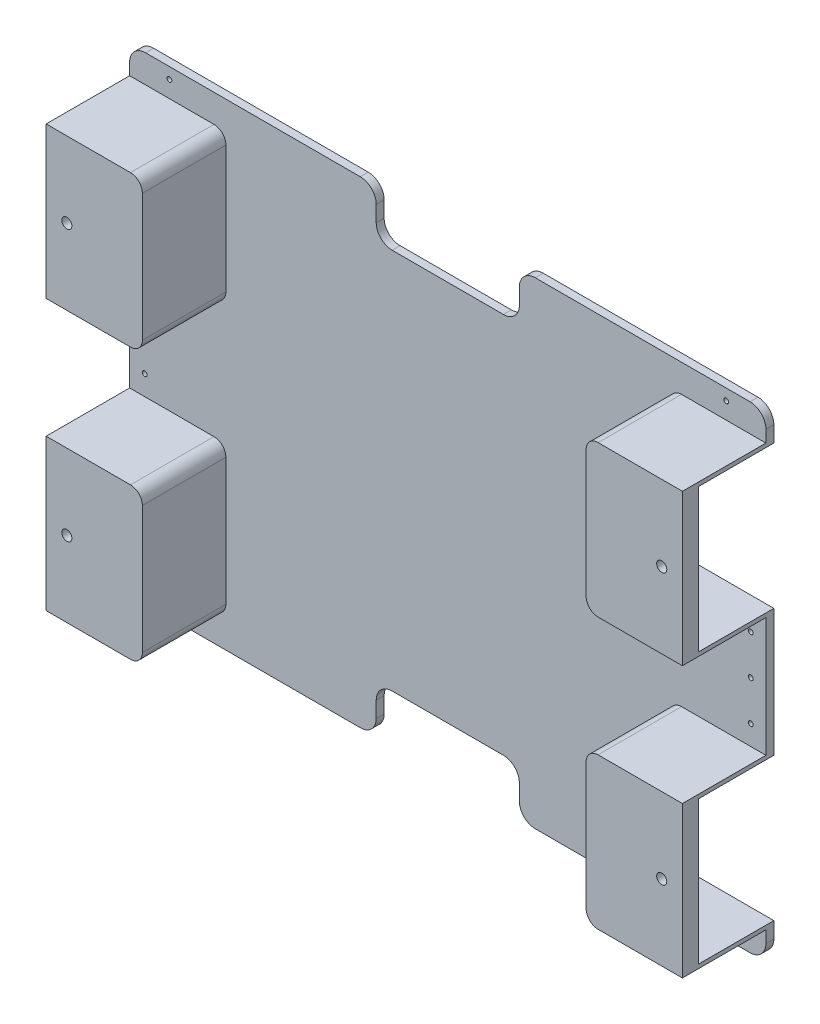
ISO-10303-21;
HEADER;
FILE_DESCRIPTION(('STEP AP214'),'2;1');
FILE_NAME('part.step','',(''),(''),'','','');
FILE_SCHEMA(('AUTOMOTIVE_DESIGN { 1 0 10303 214 1 1 1 1 }'));
ENDSEC;
DATA;
#1=APPLICATION_CONTEXT('core data for automotive mechanical design processes');
#2=APPLICATION_PROTOCOL_DEFINITION('international standard','automotive_design',2000,#1);
#3=PRODUCT_CONTEXT('',#1,'mechanical');
#4=PRODUCT('Part','Part','',(#3));
#5=PRODUCT_RELATED_PRODUCT_CATEGORY('part','',(#4));
#6=PRODUCT_DEFINITION_FORMATION('','',#4);
#7=PRODUCT_DEFINITION_CONTEXT('part definition',#1,'design');
#8=PRODUCT_DEFINITION('design','',#6,#7);
#9=PRODUCT_DEFINITION_SHAPE('','',#8);
#10=(LENGTH_UNIT() NAMED_UNIT(*) SI_UNIT(.MILLI.,.METRE.));
#11=(NAMED_UNIT(*) PLANE_ANGLE_UNIT() SI_UNIT($,.RADIAN.));
#12=(NAMED_UNIT(*) SI_UNIT($,.STERADIAN.) SOLID_ANGLE_UNIT());
#13=UNCERTAINTY_MEASURE_WITH_UNIT(LENGTH_MEASURE(1.E-05),#10,'distance_accuracy_value','');
#14=(GEOMETRIC_REPRESENTATION_CONTEXT(3) GLOBAL_UNCERTAINTY_ASSIGNED_CONTEXT((#13)) GLOBAL_UNIT_ASSIGNED_CONTEXT((#10,
#11,#12)) REPRESENTATION_CONTEXT('',''));
#15=CARTESIAN_POINT('',(0.,0.,0.));
#16=DIRECTION('',(0.,0.,1.));
#17=DIRECTION('',(1.,0.,0.));
#18=AXIS2_PLACEMENT_3D('',#15,#16,#17);
#19=CARTESIAN_POINT('',(0.,0.,10.));
#20=DIRECTION('',(0.,0.,1.));
#21=DIRECTION('',(1.,0.,0.));
#22=AXIS2_PLACEMENT_3D('',#19,#20,#21);
#23=PLANE('',#22);
#24=CARTESIAN_POINT('',(-19.0000000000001,50.0000000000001,10.));
#25=DIRECTION('',(0.,0.,1.));
#26=DIRECTION('',(-1.,0.,0.));
#27=AXIS2_PLACEMENT_3D('',#24,#25,#26);
#28=CIRCLE('',#27,3.00000000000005);
#29=CARTESIAN_POINT('',(-22.0000000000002,50.0000000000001,10.));
#30=VERTEX_POINT('',#29);
#31=EDGE_CURVE('E2125',#30,#30,#28,.T.);
#32=ORIENTED_EDGE('',*,*,#31,.F.);
#33=EDGE_LOOP('',(#32));
#34=FACE_BOUND('',#33,.T.);
#35=CARTESIAN_POINT('',(-19.0000000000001,1.11022302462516E-13,10.));
#36=DIRECTION('',(0.,0.,1.));
#37=DIRECTION('',(-1.,0.,0.));
#38=AXIS2_PLACEMENT_3D('',#35,#36,#37);
#39=CIRCLE('',#38,2.99999999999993);
#40=CARTESIAN_POINT('',(-22.0000000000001,1.11022302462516E-13,10.));
#41=VERTEX_POINT('',#40);
#42=EDGE_CURVE('E2129',#41,#41,#39,.T.);
#43=ORIENTED_EDGE('',*,*,#42,.F.);
#44=EDGE_LOOP('',(#43));
#45=FACE_BOUND('',#44,.T.);
#46=CARTESIAN_POINT('',(-19.,-49.9999999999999,10.));
#47=DIRECTION('',(0.,0.,1.));
#48=DIRECTION('',(-1.,0.,0.));
#49=AXIS2_PLACEMENT_3D('',#46,#47,#48);
#50=CIRCLE('',#49,3.00000000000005);
#51=CARTESIAN_POINT('',(-22.0000000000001,-49.9999999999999,10.));
#52=VERTEX_POINT('',#51);
#53=EDGE_CURVE('E2241',#52,#52,#50,.T.);
#54=ORIENTED_EDGE('',*,*,#53,.F.);
#55=EDGE_LOOP('',(#54));
#56=FACE_BOUND('',#55,.T.);
#57=CARTESIAN_POINT('',(-781.,-50.,10.));
#58=DIRECTION('',(0.,0.,1.));
#59=DIRECTION('',(1.,0.,0.));
#60=AXIS2_PLACEMENT_3D('',#57,#58,#59);
#61=CIRCLE('',#60,3.00000000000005);
#62=CARTESIAN_POINT('',(-778.,-50.,10.));
#63=VERTEX_POINT('',#62);
#64=EDGE_CURVE('E2233',#63,#63,#61,.T.);
#65=ORIENTED_EDGE('',*,*,#64,.F.);
#66=EDGE_LOOP('',(#65));
#67=FACE_BOUND('',#66,.T.);
#68=CARTESIAN_POINT('',(-781.,0.,10.));
#69=DIRECTION('',(0.,0.,1.));
#70=DIRECTION('',(1.,0.,0.));
#71=AXIS2_PLACEMENT_3D('',#68,#69,#70);
#72=CIRCLE('',#71,2.99999999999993);
#73=CARTESIAN_POINT('',(-778.,0.,10.));
#74=VERTEX_POINT('',#73);
#75=EDGE_CURVE('E2141',#74,#74,#72,.T.);
#76=ORIENTED_EDGE('',*,*,#75,.F.);
#77=EDGE_LOOP('',(#76));
#78=FACE_BOUND('',#77,.T.);
#79=CARTESIAN_POINT('',(-781.,50.,10.));
#80=DIRECTION('',(0.,0.,1.));
#81=DIRECTION('',(1.,0.,0.));
#82=AXIS2_PLACEMENT_3D('',#79,#80,#81);
#83=CIRCLE('',#82,3.00000000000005);
#84=CARTESIAN_POINT('',(-778.,50.,10.));
#85=VERTEX_POINT('',#84);
#86=EDGE_CURVE('E2138',#85,#85,#83,.T.);
#87=ORIENTED_EDGE('',*,*,#86,.F.);
#88=EDGE_LOOP('',(#87));
#89=FACE_BOUND('',#88,.T.);
#90=CARTESIAN_POINT('',(-50.0000000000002,286.,10.));
#91=DIRECTION('',(0.,0.,1.));
#92=DIRECTION('',(1.,0.,0.));
#93=AXIS2_PLACEMENT_3D('',#90,#91,#92);
#94=CIRCLE('',#93,3.00000000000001);
#95=CARTESIAN_POINT('',(-47.0000000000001,286.,10.));
#96=VERTEX_POINT('',#95);
#97=EDGE_CURVE('E830',#96,#96,#94,.T.);
#98=ORIENTED_EDGE('',*,*,#97,.F.);
#99=EDGE_LOOP('',(#98));
#100=FACE_BOUND('',#99,.T.);
#101=CARTESIAN_POINT('',(-750.,-286.,10.));
#102=DIRECTION('',(0.,0.,1.));
#103=DIRECTION('',(1.,0.,0.));
#104=AXIS2_PLACEMENT_3D('',#101,#102,#103);
#105=CIRCLE('',#104,3.00000000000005);
#106=CARTESIAN_POINT('',(-747.,-286.,10.));
#107=VERTEX_POINT('',#106);
#108=EDGE_CURVE('E837',#107,#107,#105,.T.);
#109=ORIENTED_EDGE('',*,*,#108,.F.);
#110=EDGE_LOOP('',(#109));
#111=FACE_BOUND('',#110,.T.);
#112=CARTESIAN_POINT('',(-50.0000000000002,-286.,10.));
#113=DIRECTION('',(0.,0.,1.));
#114=DIRECTION('',(1.,0.,0.));
#115=AXIS2_PLACEMENT_3D('',#112,#113,#114);
#116=CIRCLE('',#115,3.);
#117=CARTESIAN_POINT('',(-47.0000000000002,-286.,10.));
#118=VERTEX_POINT('',#117);
#119=EDGE_CURVE('E824',#118,#118,#116,.T.);
#120=ORIENTED_EDGE('',*,*,#119,.F.);
#121=EDGE_LOOP('',(#120));
#122=FACE_BOUND('',#121,.T.);
#123=CARTESIAN_POINT('',(-750.,286.,10.));
#124=DIRECTION('',(0.,0.,1.));
#125=DIRECTION('',(1.,0.,0.));
#126=AXIS2_PLACEMENT_3D('',#123,#124,#125);
#127=CIRCLE('',#126,3.00000000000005);
#128=CARTESIAN_POINT('',(-747.,286.,10.));
#129=VERTEX_POINT('',#128);
#130=EDGE_CURVE('E833',#129,#129,#127,.T.);
#131=ORIENTED_EDGE('',*,*,#130,.F.);
#132=EDGE_LOOP('',(#131));
#133=FACE_BOUND('',#132,.T.);
#134=CARTESIAN_POINT('',(-694.,-250.,10.));
#135=DIRECTION('',(0.,0.,1.));
#136=DIRECTION('',(1.,0.,0.));
#137=AXIS2_PLACEMENT_3D('',#134,#135,#136);
#138=CIRCLE('',#137,15.);
#139=CARTESIAN_POINT('',(-694.,-265.,9.99999999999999));
#140=VERTEX_POINT('',#139);
#141=CARTESIAN_POINT('',(-679.,-250.,10.));
#142=VERTEX_POINT('',#141);
#143=EDGE_CURVE('E62',#140,#142,#138,.T.);
#144=ORIENTED_EDGE('',*,*,#143,.F.);
#145=DIRECTION('',(1.,0.,0.));
#146=VECTOR('',#145,1.);
#147=CARTESIAN_POINT('',(-694.,-265.,10.));
#148=LINE('',#147,#146);
#149=CARTESIAN_POINT('',(-800.,-265.,10.));
#150=VERTEX_POINT('',#149);
#151=EDGE_CURVE('E626',#150,#140,#148,.T.);
#152=ORIENTED_EDGE('',*,*,#151,.F.);
#153=DIRECTION('',(0.,-1.,0.));
#154=VECTOR('',#153,1.);
#155=CARTESIAN_POINT('',(-800.,300.,10.));
#156=LINE('',#155,#154);
#157=CARTESIAN_POINT('',(-800.,-280.,10.));
#158=VERTEX_POINT('',#157);
#159=EDGE_CURVE('E852',#150,#158,#156,.T.);
#160=ORIENTED_EDGE('',*,*,#159,.T.);
#161=CARTESIAN_POINT('',(-780.,-280.,10.));
#162=DIRECTION('',(0.,0.,1.));
#163=DIRECTION('',(1.,0.,0.));
#164=AXIS2_PLACEMENT_3D('',#161,#162,#163);
#165=CIRCLE('',#164,20.);
#166=CARTESIAN_POINT('',(-780.,-300.,10.));
#167=VERTEX_POINT('',#166);
#168=EDGE_CURVE('E956',#158,#167,#165,.T.);
#169=ORIENTED_EDGE('',*,*,#168,.T.);
#170=DIRECTION('',(1.,0.,0.));
#171=VECTOR('',#170,1.);
#172=CARTESIAN_POINT('',(-800.,-300.,10.));
#173=LINE('',#172,#171);
#174=CARTESIAN_POINT('',(-510.,-300.,10.));
#175=VERTEX_POINT('',#174);
#176=EDGE_CURVE('E850',#167,#175,#173,.T.);
#177=ORIENTED_EDGE('',*,*,#176,.T.);
#178=CARTESIAN_POINT('',(-510.,-280.,10.));
#179=DIRECTION('',(0.,0.,1.));
#180=DIRECTION('',(1.,0.,0.));
#181=AXIS2_PLACEMENT_3D('',#178,#179,#180);
#182=CIRCLE('',#181,20.);
#183=CARTESIAN_POINT('',(-490.,-280.,10.));
#184=VERTEX_POINT('',#183);
#185=EDGE_CURVE('E958',#175,#184,#182,.T.);
#186=ORIENTED_EDGE('',*,*,#185,.T.);
#187=DIRECTION('',(0.,1.,0.));
#188=VECTOR('',#187,1.);
#189=CARTESIAN_POINT('',(-490.,-300.,10.));
#190=LINE('',#189,#188);
#191=CARTESIAN_POINT('',(-490.,-260.,10.));
#192=VERTEX_POINT('',#191);
#193=EDGE_CURVE('E855',#184,#192,#190,.T.);
#194=ORIENTED_EDGE('',*,*,#193,.T.);
#195=CARTESIAN_POINT('',(-470.,-260.,10.));
#196=DIRECTION('',(0.,0.,1.));
#197=DIRECTION('',(1.,0.,0.));
#198=AXIS2_PLACEMENT_3D('',#195,#196,#197);
#199=CIRCLE('',#198,20.);
#200=CARTESIAN_POINT('',(-470.,-240.,10.));
#201=VERTEX_POINT('',#200);
#202=EDGE_CURVE('E1035',#192,#201,#199,.F.);
#203=ORIENTED_EDGE('',*,*,#202,.T.);
#204=DIRECTION('',(1.,0.,0.));
#205=VECTOR('',#204,1.);
#206=CARTESIAN_POINT('',(-490.,-240.,10.));
#207=LINE('',#206,#205);
#208=CARTESIAN_POINT('',(-330.,-240.,10.));
#209=VERTEX_POINT('',#208);
#210=EDGE_CURVE('E858',#201,#209,#207,.T.);
#211=ORIENTED_EDGE('',*,*,#210,.T.);
#212=CARTESIAN_POINT('',(-330.,-260.,10.));
#213=DIRECTION('',(0.,0.,1.));
#214=DIRECTION('',(1.,0.,0.));
#215=AXIS2_PLACEMENT_3D('',#212,#213,#214);
#216=CIRCLE('',#215,20.);
#217=CARTESIAN_POINT('',(-310.,-260.,10.));
#218=VERTEX_POINT('',#217);
#219=EDGE_CURVE('E1031',#209,#218,#216,.F.);
#220=ORIENTED_EDGE('',*,*,#219,.T.);
#221=DIRECTION('',(0.,-1.,0.));
#222=VECTOR('',#221,1.);
#223=CARTESIAN_POINT('',(-310.,-240.,10.));
#224=LINE('',#223,#222);
#225=CARTESIAN_POINT('',(-310.,-280.,10.));
#226=VERTEX_POINT('',#225);
#227=EDGE_CURVE('E861',#218,#226,#224,.T.);
#228=ORIENTED_EDGE('',*,*,#227,.T.);
#229=CARTESIAN_POINT('',(-290.,-280.,10.));
#230=DIRECTION('',(0.,0.,1.));
#231=DIRECTION('',(1.,0.,0.));
#232=AXIS2_PLACEMENT_3D('',#229,#230,#231);
#233=CIRCLE('',#232,20.);
#234=CARTESIAN_POINT('',(-290.,-300.,10.));
#235=VERTEX_POINT('',#234);
#236=EDGE_CURVE('E960',#226,#235,#233,.T.);
#237=ORIENTED_EDGE('',*,*,#236,.T.);
#238=DIRECTION('',(1.,0.,0.));
#239=VECTOR('',#238,1.);
#240=CARTESIAN_POINT('',(-310.,-300.,10.));
#241=LINE('',#240,#239);
#242=CARTESIAN_POINT('',(-19.9999999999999,-300.,10.));
#243=VERTEX_POINT('',#242);
#244=EDGE_CURVE('E864',#235,#243,#241,.T.);
#245=ORIENTED_EDGE('',*,*,#244,.T.);
#246=CARTESIAN_POINT('',(-19.9999999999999,-280.,10.));
#247=DIRECTION('',(0.,0.,1.));
#248=DIRECTION('',(1.,0.,0.));
#249=AXIS2_PLACEMENT_3D('',#246,#247,#248);
#250=CIRCLE('',#249,20.);
#251=CARTESIAN_POINT('',(0.,-280.,10.));
#252=VERTEX_POINT('',#251);
#253=EDGE_CURVE('E962',#243,#252,#250,.T.);
#254=ORIENTED_EDGE('',*,*,#253,.T.);
#255=DIRECTION('',(0.,1.,0.));
#256=VECTOR('',#255,1.);
#257=CARTESIAN_POINT('',(0.,300.,10.));
#258=LINE('',#257,#256);
#259=CARTESIAN_POINT('',(0.,-265.,10.));
#260=VERTEX_POINT('',#259);
#261=EDGE_CURVE('E868',#252,#260,#258,.T.);
#262=ORIENTED_EDGE('',*,*,#261,.T.);
#263=DIRECTION('',(1.,0.,0.));
#264=VECTOR('',#263,1.);
#265=CARTESIAN_POINT('',(0.,-265.,10.));
#266=LINE('',#265,#264);
#267=CARTESIAN_POINT('',(-106.,-265.,10.));
#268=VERTEX_POINT('',#267);
#269=EDGE_CURVE('E698',#268,#260,#266,.T.);
#270=ORIENTED_EDGE('',*,*,#269,.F.);
#271=CARTESIAN_POINT('',(-106.,-250.,10.));
#272=DIRECTION('',(0.,0.,1.));
#273=DIRECTION('',(1.,0.,0.));
#274=AXIS2_PLACEMENT_3D('',#271,#272,#273);
#275=CIRCLE('',#274,15.);
#276=CARTESIAN_POINT('',(-121.,-250.,9.99999999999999));
#277=VERTEX_POINT('',#276);
#278=EDGE_CURVE('E701',#277,#268,#275,.T.);
#279=ORIENTED_EDGE('',*,*,#278,.F.);
#280=DIRECTION('',(0.,-1.,0.));
#281=VECTOR('',#280,1.);
#282=CARTESIAN_POINT('',(-121.,-250.,10.));
#283=LINE('',#282,#281);
#284=CARTESIAN_POINT('',(-121.,-89.9999999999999,10.));
#285=VERTEX_POINT('',#284);
#286=EDGE_CURVE('E705',#285,#277,#283,.T.);
#287=ORIENTED_EDGE('',*,*,#286,.F.);
#288=CARTESIAN_POINT('',(-106.,-89.9999999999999,10.));
#289=DIRECTION('',(0.,0.,1.));
#290=DIRECTION('',(1.,0.,0.));
#291=AXIS2_PLACEMENT_3D('',#288,#289,#290);
#292=CIRCLE('',#291,15.);
#293=CARTESIAN_POINT('',(-106.,-74.9999999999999,9.99999999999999));
#294=VERTEX_POINT('',#293);
#295=EDGE_CURVE('E708',#294,#285,#292,.T.);
#296=ORIENTED_EDGE('',*,*,#295,.F.);
#297=DIRECTION('',(-1.,0.,0.));
#298=VECTOR('',#297,1.);
#299=CARTESIAN_POINT('',(-106.,-74.9999999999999,10.));
#300=LINE('',#299,#298);
#301=CARTESIAN_POINT('',(0.,-74.9999999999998,10.));
#302=VERTEX_POINT('',#301);
#303=EDGE_CURVE('E711',#302,#294,#300,.T.);
#304=ORIENTED_EDGE('',*,*,#303,.F.);
#305=CARTESIAN_POINT('',(0.,74.9999999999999,10.));
#306=VERTEX_POINT('',#305);
#307=EDGE_CURVE('E871',#302,#306,#258,.T.);
#308=ORIENTED_EDGE('',*,*,#307,.T.);
#309=DIRECTION('',(1.,0.,0.));
#310=VECTOR('',#309,1.);
#311=CARTESIAN_POINT('',(0.,74.9999999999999,10.));
#312=LINE('',#311,#310);
#313=CARTESIAN_POINT('',(-106.,74.9999999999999,10.));
#314=VERTEX_POINT('',#313);
#315=EDGE_CURVE('E653',#314,#306,#312,.T.);
#316=ORIENTED_EDGE('',*,*,#315,.F.);
#317=CARTESIAN_POINT('',(-106.,89.9999999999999,10.));
#318=DIRECTION('',(0.,0.,1.));
#319=DIRECTION('',(1.,0.,0.));
#320=AXIS2_PLACEMENT_3D('',#317,#318,#319);
#321=CIRCLE('',#320,15.);
#322=CARTESIAN_POINT('',(-121.,89.9999999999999,9.99999999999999));
#323=VERTEX_POINT('',#322);
#324=EDGE_CURVE('E656',#323,#314,#321,.T.);
#325=ORIENTED_EDGE('',*,*,#324,.F.);
#326=DIRECTION('',(0.,-1.,0.));
#327=VECTOR('',#326,1.);
#328=CARTESIAN_POINT('',(-121.,89.9999999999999,10.));
#329=LINE('',#328,#327);
#330=CARTESIAN_POINT('',(-121.,250.,10.));
#331=VERTEX_POINT('',#330);
#332=EDGE_CURVE('E500',#331,#323,#329,.T.);
#333=ORIENTED_EDGE('',*,*,#332,.F.);
#334=CARTESIAN_POINT('',(-106.,250.,10.));
#335=DIRECTION('',(0.,0.,1.));
#336=DIRECTION('',(1.,0.,0.));
#337=AXIS2_PLACEMENT_3D('',#334,#335,#336);
#338=CIRCLE('',#337,15.);
#339=CARTESIAN_POINT('',(-106.,265.,9.99999999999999));
#340=VERTEX_POINT('',#339);
#341=EDGE_CURVE('E660',#340,#331,#338,.T.);
#342=ORIENTED_EDGE('',*,*,#341,.F.);
#343=DIRECTION('',(-1.,0.,0.));
#344=VECTOR('',#343,1.);
#345=CARTESIAN_POINT('',(-106.,265.,10.));
#346=LINE('',#345,#344);
#347=CARTESIAN_POINT('',(0.,265.,10.));
#348=VERTEX_POINT('',#347);
#349=EDGE_CURVE('E663',#348,#340,#346,.T.);
#350=ORIENTED_EDGE('',*,*,#349,.F.);
#351=CARTESIAN_POINT('',(0.,280.,10.));
#352=VERTEX_POINT('',#351);
#353=EDGE_CURVE('E867',#348,#352,#258,.T.);
#354=ORIENTED_EDGE('',*,*,#353,.T.);
#355=CARTESIAN_POINT('',(-20.,280.,10.));
#356=DIRECTION('',(0.,0.,1.));
#357=DIRECTION('',(1.,0.,0.));
#358=AXIS2_PLACEMENT_3D('',#355,#356,#357);
#359=CIRCLE('',#358,20.);
#360=CARTESIAN_POINT('',(-20.,300.,10.));
#361=VERTEX_POINT('',#360);
#362=EDGE_CURVE('E954',#352,#361,#359,.T.);
#363=ORIENTED_EDGE('',*,*,#362,.T.);
#364=DIRECTION('',(-1.,0.,0.));
#365=VECTOR('',#364,1.);
#366=CARTESIAN_POINT('',(-310.,300.,10.));
#367=LINE('',#366,#365);
#368=CARTESIAN_POINT('',(-290.,300.,10.));
#369=VERTEX_POINT('',#368);
#370=EDGE_CURVE('E870',#361,#369,#367,.T.);
#371=ORIENTED_EDGE('',*,*,#370,.T.);
#372=CARTESIAN_POINT('',(-290.,280.,10.));
#373=DIRECTION('',(0.,0.,1.));
#374=DIRECTION('',(1.,0.,0.));
#375=AXIS2_PLACEMENT_3D('',#372,#373,#374);
#376=CIRCLE('',#375,20.);
#377=CARTESIAN_POINT('',(-310.,280.,10.));
#378=VERTEX_POINT('',#377);
#379=EDGE_CURVE('E964',#369,#378,#376,.T.);
#380=ORIENTED_EDGE('',*,*,#379,.T.);
#381=DIRECTION('',(0.,-1.,0.));
#382=VECTOR('',#381,1.);
#383=CARTESIAN_POINT('',(-310.,240.,10.));
#384=LINE('',#383,#382);
#385=CARTESIAN_POINT('',(-310.,260.,10.));
#386=VERTEX_POINT('',#385);
#387=EDGE_CURVE('E874',#378,#386,#384,.T.);
#388=ORIENTED_EDGE('',*,*,#387,.T.);
#389=CARTESIAN_POINT('',(-330.,260.,10.));
#390=DIRECTION('',(0.,0.,1.));
#391=DIRECTION('',(1.,0.,0.));
#392=AXIS2_PLACEMENT_3D('',#389,#390,#391);
#393=CIRCLE('',#392,20.);
#394=CARTESIAN_POINT('',(-330.,240.,10.));
#395=VERTEX_POINT('',#394);
#396=EDGE_CURVE('E1027',#386,#395,#393,.F.);
#397=ORIENTED_EDGE('',*,*,#396,.T.);
#398=DIRECTION('',(-1.,0.,0.));
#399=VECTOR('',#398,1.);
#400=CARTESIAN_POINT('',(-490.,240.,10.));
#401=LINE('',#400,#399);
#402=CARTESIAN_POINT('',(-470.,240.,10.));
#403=VERTEX_POINT('',#402);
#404=EDGE_CURVE('E877',#395,#403,#401,.T.);
#405=ORIENTED_EDGE('',*,*,#404,.T.);
#406=CARTESIAN_POINT('',(-470.,260.,10.));
#407=DIRECTION('',(0.,0.,1.));
#408=DIRECTION('',(1.,0.,0.));
#409=AXIS2_PLACEMENT_3D('',#406,#407,#408);
#410=CIRCLE('',#409,20.);
#411=CARTESIAN_POINT('',(-490.,260.,10.));
#412=VERTEX_POINT('',#411);
#413=EDGE_CURVE('E1023',#403,#412,#410,.F.);
#414=ORIENTED_EDGE('',*,*,#413,.T.);
#415=DIRECTION('',(0.,1.,0.));
#416=VECTOR('',#415,1.);
#417=CARTESIAN_POINT('',(-490.,300.,10.));
#418=LINE('',#417,#416);
#419=CARTESIAN_POINT('',(-490.,280.,10.));
#420=VERTEX_POINT('',#419);
#421=EDGE_CURVE('E880',#412,#420,#418,.T.);
#422=ORIENTED_EDGE('',*,*,#421,.T.);
#423=CARTESIAN_POINT('',(-510.,280.,10.));
#424=DIRECTION('',(0.,0.,1.));
#425=DIRECTION('',(1.,0.,0.));
#426=AXIS2_PLACEMENT_3D('',#423,#424,#425);
#427=CIRCLE('',#426,20.);
#428=CARTESIAN_POINT('',(-510.,300.,10.));
#429=VERTEX_POINT('',#428);
#430=EDGE_CURVE('E966',#420,#429,#427,.T.);
#431=ORIENTED_EDGE('',*,*,#430,.T.);
#432=DIRECTION('',(-1.,0.,0.));
#433=VECTOR('',#432,1.);
#434=CARTESIAN_POINT('',(-800.,300.,10.));
#435=LINE('',#434,#433);
#436=CARTESIAN_POINT('',(-780.,300.,10.));
#437=VERTEX_POINT('',#436);
#438=EDGE_CURVE('E883',#429,#437,#435,.T.);
#439=ORIENTED_EDGE('',*,*,#438,.T.);
#440=CARTESIAN_POINT('',(-780.,280.,10.));
#441=DIRECTION('',(0.,0.,1.));
#442=DIRECTION('',(1.,0.,0.));
#443=AXIS2_PLACEMENT_3D('',#440,#441,#442);
#444=CIRCLE('',#443,20.);
#445=CARTESIAN_POINT('',(-800.,280.,10.));
#446=VERTEX_POINT('',#445);
#447=EDGE_CURVE('E968',#437,#446,#444,.T.);
#448=ORIENTED_EDGE('',*,*,#447,.T.);
#449=CARTESIAN_POINT('',(-800.,265.,10.));
#450=VERTEX_POINT('',#449);
#451=EDGE_CURVE('E848',#446,#450,#156,.T.);
#452=ORIENTED_EDGE('',*,*,#451,.T.);
#453=DIRECTION('',(-1.,0.,0.));
#454=VECTOR('',#453,1.);
#455=CARTESIAN_POINT('',(-800.,265.,10.));
#456=LINE('',#455,#454);
#457=CARTESIAN_POINT('',(-694.,265.,10.));
#458=VERTEX_POINT('',#457);
#459=EDGE_CURVE('E732',#458,#450,#456,.T.);
#460=ORIENTED_EDGE('',*,*,#459,.F.);
#461=CARTESIAN_POINT('',(-694.,250.,10.));
#462=DIRECTION('',(0.,0.,1.));
#463=DIRECTION('',(1.,0.,0.));
#464=AXIS2_PLACEMENT_3D('',#461,#462,#463);
#465=CIRCLE('',#464,15.);
#466=CARTESIAN_POINT('',(-679.,250.,9.99999999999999));
#467=VERTEX_POINT('',#466);
#468=EDGE_CURVE('E753',#467,#458,#465,.T.);
#469=ORIENTED_EDGE('',*,*,#468,.F.);
#470=DIRECTION('',(0.,1.,0.));
#471=VECTOR('',#470,1.);
#472=CARTESIAN_POINT('',(-679.,250.,10.));
#473=LINE('',#472,#471);
#474=CARTESIAN_POINT('',(-679.,89.9999999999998,10.));
#475=VERTEX_POINT('',#474);
#476=EDGE_CURVE('E750',#475,#467,#473,.T.);
#477=ORIENTED_EDGE('',*,*,#476,.F.);
#478=CARTESIAN_POINT('',(-694.,89.9999999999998,10.));
#479=DIRECTION('',(0.,0.,1.));
#480=DIRECTION('',(1.,0.,0.));
#481=AXIS2_PLACEMENT_3D('',#478,#479,#480);
#482=CIRCLE('',#481,15.);
#483=CARTESIAN_POINT('',(-694.,74.9999999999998,9.99999999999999));
#484=VERTEX_POINT('',#483);
#485=EDGE_CURVE('E747',#484,#475,#482,.T.);
#486=ORIENTED_EDGE('',*,*,#485,.F.);
#487=DIRECTION('',(1.,0.,0.));
#488=VECTOR('',#487,1.);
#489=CARTESIAN_POINT('',(-694.,74.9999999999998,10.));
#490=LINE('',#489,#488);
#491=CARTESIAN_POINT('',(-800.,74.9999999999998,10.));
#492=VERTEX_POINT('',#491);
#493=EDGE_CURVE('E714',#492,#484,#490,.T.);
#494=ORIENTED_EDGE('',*,*,#493,.F.);
#495=CARTESIAN_POINT('',(-800.,-74.9999999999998,10.));
#496=VERTEX_POINT('',#495);
#497=EDGE_CURVE('E851',#492,#496,#156,.T.);
#498=ORIENTED_EDGE('',*,*,#497,.T.);
#499=DIRECTION('',(-1.,0.,0.));
#500=VECTOR('',#499,1.);
#501=CARTESIAN_POINT('',(-800.,-74.9999999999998,10.));
#502=LINE('',#501,#500);
#503=CARTESIAN_POINT('',(-694.,-75.,10.));
#504=VERTEX_POINT('',#503);
#505=EDGE_CURVE('E617',#504,#496,#502,.T.);
#506=ORIENTED_EDGE('',*,*,#505,.F.);
#507=CARTESIAN_POINT('',(-694.,-89.9999999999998,10.));
#508=DIRECTION('',(0.,0.,1.));
#509=DIRECTION('',(1.,0.,0.));
#510=AXIS2_PLACEMENT_3D('',#507,#508,#509);
#511=CIRCLE('',#510,14.9999999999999);
#512=CARTESIAN_POINT('',(-679.,-89.9999999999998,9.99999999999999));
#513=VERTEX_POINT('',#512);
#514=EDGE_CURVE('E620',#513,#504,#511,.T.);
#515=ORIENTED_EDGE('',*,*,#514,.F.);
#516=DIRECTION('',(0.,1.,0.));
#517=VECTOR('',#516,1.);
#518=CARTESIAN_POINT('',(-679.,-89.9999999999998,10.));
#519=LINE('',#518,#517);
#520=EDGE_CURVE('E67',#142,#513,#519,.T.);
#521=ORIENTED_EDGE('',*,*,#520,.F.);
#522=EDGE_LOOP('',(#144,#152,#160,#169,#177,#186,#194,#203,#211,#220,#228,#237,#245,#254,#262,
#270,#279,#287,#296,#304,#308,#316,#325,#333,#342,#350,#354,#363,#371,#380,#388,#397,#405,#414,
#422,#431,#439,#448,#452,#460,#469,#477,#486,#494,#498,#506,#515,#521));
#523=FACE_BOUND('',#522,.T.);
#524=ADVANCED_FACE('F47',(#34,#45,#56,#67,#78,#89,#100,#111,#122,#133,#523),#23,.T.);
#525=CARTESIAN_POINT('',(-800.,300.,10.));
#526=DIRECTION('',(1.,0.,0.));
#527=DIRECTION('',(0.,0.,-1.));
#528=AXIS2_PLACEMENT_3D('',#525,#526,#527);
#529=PLANE('',#528);
#530=DIRECTION('',(0.,-1.,0.));
#531=VECTOR('',#530,1.);
#532=CARTESIAN_POINT('',(-800.,300.,0.));
#533=LINE('',#532,#531);
#534=CARTESIAN_POINT('',(-800.,280.,0.));
#535=VERTEX_POINT('',#534);
#536=CARTESIAN_POINT('',(-800.,260.,0.));
#537=VERTEX_POINT('',#536);
#538=EDGE_CURVE('E887',#535,#537,#533,.T.);
#539=ORIENTED_EDGE('',*,*,#538,.T.);
#540=DIRECTION('',(0.,0.,1.));
#541=VECTOR('',#540,1.);
#542=CARTESIAN_POINT('',(-800.,260.,0.));
#543=LINE('',#542,#541);
#544=CARTESIAN_POINT('',(-800.,260.,95.));
#545=VERTEX_POINT('',#544);
#546=EDGE_CURVE('E776',#537,#545,#543,.T.);
#547=ORIENTED_EDGE('',*,*,#546,.T.);
#548=DIRECTION('',(0.,-1.,0.));
#549=VECTOR('',#548,1.);
#550=CARTESIAN_POINT('',(-800.,0.,95.));
#551=LINE('',#550,#549);
#552=CARTESIAN_POINT('',(-800.,79.9999999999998,95.));
#553=VERTEX_POINT('',#552);
#554=EDGE_CURVE('E575',#545,#553,#551,.T.);
#555=ORIENTED_EDGE('',*,*,#554,.T.);
#556=DIRECTION('',(0.,0.,1.));
#557=VECTOR('',#556,1.);
#558=CARTESIAN_POINT('',(-800.,79.9999999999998,0.));
#559=LINE('',#558,#557);
#560=CARTESIAN_POINT('',(-800.,79.9999999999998,0.));
#561=VERTEX_POINT('',#560);
#562=EDGE_CURVE('E779',#561,#553,#559,.T.);
#563=ORIENTED_EDGE('',*,*,#562,.F.);
#564=CARTESIAN_POINT('',(-800.,-79.9999999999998,0.));
#565=VERTEX_POINT('',#564);
#566=EDGE_CURVE('E891',#561,#565,#533,.T.);
#567=ORIENTED_EDGE('',*,*,#566,.T.);
#568=DIRECTION('',(0.,0.,1.));
#569=VECTOR('',#568,1.);
#570=CARTESIAN_POINT('',(-800.,-79.9999999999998,0.));
#571=LINE('',#570,#569);
#572=CARTESIAN_POINT('',(-800.,-79.9999999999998,95.));
#573=VERTEX_POINT('',#572);
#574=EDGE_CURVE('E793',#565,#573,#571,.T.);
#575=ORIENTED_EDGE('',*,*,#574,.T.);
#576=DIRECTION('',(0.,-1.,0.));
#577=VECTOR('',#576,1.);
#578=CARTESIAN_POINT('',(-800.,0.,95.));
#579=LINE('',#578,#577);
#580=CARTESIAN_POINT('',(-800.,-260.,95.));
#581=VERTEX_POINT('',#580);
#582=EDGE_CURVE('E554',#573,#581,#579,.T.);
#583=ORIENTED_EDGE('',*,*,#582,.T.);
#584=DIRECTION('',(0.,0.,1.));
#585=VECTOR('',#584,1.);
#586=CARTESIAN_POINT('',(-800.,-260.,0.));
#587=LINE('',#586,#585);
#588=CARTESIAN_POINT('',(-800.,-260.,0.));
#589=VERTEX_POINT('',#588);
#590=EDGE_CURVE('E790',#589,#581,#587,.T.);
#591=ORIENTED_EDGE('',*,*,#590,.F.);
#592=CARTESIAN_POINT('',(-800.,-280.,0.));
#593=VERTEX_POINT('',#592);
#594=EDGE_CURVE('E845',#589,#593,#533,.T.);
#595=ORIENTED_EDGE('',*,*,#594,.T.);
#596=DIRECTION('',(0.,0.,-1.));
#597=VECTOR('',#596,1.);
#598=CARTESIAN_POINT('',(-800.,-280.,10.));
#599=LINE('',#598,#597);
#600=EDGE_CURVE('E886',#593,#158,#599,.F.);
#601=ORIENTED_EDGE('',*,*,#600,.T.);
#602=ORIENTED_EDGE('',*,*,#159,.F.);
#603=DIRECTION('',(0.,0.,-1.));
#604=VECTOR('',#603,1.);
#605=CARTESIAN_POINT('',(-800.,-265.,95.));
#606=LINE('',#605,#604);
#607=CARTESIAN_POINT('',(-800.,-265.,115.));
#608=VERTEX_POINT('',#607);
#609=EDGE_CURVE('E596',#608,#150,#606,.T.);
#610=ORIENTED_EDGE('',*,*,#609,.F.);
#611=DIRECTION('',(0.,-1.,0.));
#612=VECTOR('',#611,1.);
#613=CARTESIAN_POINT('',(-800.,0.,115.));
#614=LINE('',#613,#612);
#615=CARTESIAN_POINT('',(-800.,-74.9999999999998,115.));
#616=VERTEX_POINT('',#615);
#617=EDGE_CURVE('E566',#616,#608,#614,.T.);
#618=ORIENTED_EDGE('',*,*,#617,.F.);
#619=DIRECTION('',(0.,0.,-1.));
#620=VECTOR('',#619,1.);
#621=CARTESIAN_POINT('',(-800.,-74.9999999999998,95.));
#622=LINE('',#621,#620);
#623=EDGE_CURVE('E613',#616,#496,#622,.T.);
#624=ORIENTED_EDGE('',*,*,#623,.T.);
#625=ORIENTED_EDGE('',*,*,#497,.F.);
#626=DIRECTION('',(0.,0.,-1.));
#627=VECTOR('',#626,1.);
#628=CARTESIAN_POINT('',(-800.,74.9999999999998,95.));
#629=LINE('',#628,#627);
#630=CARTESIAN_POINT('',(-800.,74.9999999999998,115.));
#631=VERTEX_POINT('',#630);
#632=EDGE_CURVE('E772',#631,#492,#629,.T.);
#633=ORIENTED_EDGE('',*,*,#632,.F.);
#634=DIRECTION('',(0.,-1.,0.));
#635=VECTOR('',#634,1.);
#636=CARTESIAN_POINT('',(-800.,0.,115.));
#637=LINE('',#636,#635);
#638=CARTESIAN_POINT('',(-800.,265.,115.));
#639=VERTEX_POINT('',#638);
#640=EDGE_CURVE('E581',#639,#631,#637,.T.);
#641=ORIENTED_EDGE('',*,*,#640,.F.);
#642=DIRECTION('',(0.,0.,-1.));
#643=VECTOR('',#642,1.);
#644=CARTESIAN_POINT('',(-800.,265.,95.));
#645=LINE('',#644,#643);
#646=EDGE_CURVE('E744',#639,#450,#645,.T.);
#647=ORIENTED_EDGE('',*,*,#646,.T.);
#648=ORIENTED_EDGE('',*,*,#451,.F.);
#649=DIRECTION('',(0.,0.,-1.));
#650=VECTOR('',#649,1.);
#651=CARTESIAN_POINT('',(-800.,280.,10.));
#652=LINE('',#651,#650);
#653=EDGE_CURVE('E928',#446,#535,#652,.T.);
#654=ORIENTED_EDGE('',*,*,#653,.T.);
#655=EDGE_LOOP('',(#539,#547,#555,#563,#567,#575,#583,#591,#595,#601,#602,#610,#618,#624,#625,
#633,#641,#647,#648,#654));
#656=FACE_BOUND('',#655,.T.);
#657=ADVANCED_FACE('F1109',(#656),#529,.F.);
#658=CARTESIAN_POINT('',(-800.,-300.,10.));
#659=DIRECTION('',(0.,1.,0.));
#660=DIRECTION('',(-1.,0.,0.));
#661=AXIS2_PLACEMENT_3D('',#658,#659,#660);
#662=PLANE('',#661);
#663=DIRECTION('',(1.,0.,0.));
#664=VECTOR('',#663,1.);
#665=CARTESIAN_POINT('',(-800.,-300.,0.));
#666=LINE('',#665,#664);
#667=CARTESIAN_POINT('',(-780.,-300.,0.));
#668=VERTEX_POINT('',#667);
#669=CARTESIAN_POINT('',(-510.,-300.,0.));
#670=VERTEX_POINT('',#669);
#671=EDGE_CURVE('E890',#668,#670,#666,.T.);
#672=ORIENTED_EDGE('',*,*,#671,.T.);
#673=DIRECTION('',(0.,0.,-1.));
#674=VECTOR('',#673,1.);
#675=CARTESIAN_POINT('',(-510.,-300.,10.));
#676=LINE('',#675,#674);
#677=EDGE_CURVE('E1019',#670,#175,#676,.F.);
#678=ORIENTED_EDGE('',*,*,#677,.T.);
#679=ORIENTED_EDGE('',*,*,#176,.F.);
#680=DIRECTION('',(0.,0.,-1.));
#681=VECTOR('',#680,1.);
#682=CARTESIAN_POINT('',(-780.,-300.,10.));
#683=LINE('',#682,#681);
#684=EDGE_CURVE('E1016',#167,#668,#683,.T.);
#685=ORIENTED_EDGE('',*,*,#684,.T.);
#686=EDGE_LOOP('',(#672,#678,#679,#685));
#687=FACE_BOUND('',#686,.T.);
#688=ADVANCED_FACE('F1152',(#687),#662,.F.);
#689=CARTESIAN_POINT('',(-490.,-300.,10.));
#690=DIRECTION('',(-1.,0.,0.));
#691=DIRECTION('',(0.,-1.,0.));
#692=AXIS2_PLACEMENT_3D('',#689,#690,#691);
#693=PLANE('',#692);
#694=DIRECTION('',(0.,1.,0.));
#695=VECTOR('',#694,1.);
#696=CARTESIAN_POINT('',(-490.,-300.,0.));
#697=LINE('',#696,#695);
#698=CARTESIAN_POINT('',(-490.,-280.,0.));
#699=VERTEX_POINT('',#698);
#700=CARTESIAN_POINT('',(-490.,-260.,0.));
#701=VERTEX_POINT('',#700);
#702=EDGE_CURVE('E894',#699,#701,#697,.T.);
#703=ORIENTED_EDGE('',*,*,#702,.T.);
#704=DIRECTION('',(0.,0.,-1.));
#705=VECTOR('',#704,1.);
#706=CARTESIAN_POINT('',(-490.,-260.,10.));
#707=LINE('',#706,#705);
#708=EDGE_CURVE('E1014',#701,#192,#707,.F.);
#709=ORIENTED_EDGE('',*,*,#708,.T.);
#710=ORIENTED_EDGE('',*,*,#193,.F.);
#711=DIRECTION('',(0.,0.,-1.));
#712=VECTOR('',#711,1.);
#713=CARTESIAN_POINT('',(-490.,-280.,10.));
#714=LINE('',#713,#712);
#715=EDGE_CURVE('E1011',#184,#699,#714,.T.);
#716=ORIENTED_EDGE('',*,*,#715,.T.);
#717=EDGE_LOOP('',(#703,#709,#710,#716));
#718=FACE_BOUND('',#717,.T.);
#719=ADVANCED_FACE('F1161',(#718),#693,.F.);
#720=CARTESIAN_POINT('',(-490.,-240.,10.));
#721=DIRECTION('',(0.,1.,0.));
#722=DIRECTION('',(-1.,0.,0.));
#723=AXIS2_PLACEMENT_3D('',#720,#721,#722);
#724=PLANE('',#723);
#725=DIRECTION('',(1.,0.,0.));
#726=VECTOR('',#725,1.);
#727=CARTESIAN_POINT('',(-490.,-240.,0.));
#728=LINE('',#727,#726);
#729=CARTESIAN_POINT('',(-470.,-240.,0.));
#730=VERTEX_POINT('',#729);
#731=CARTESIAN_POINT('',(-330.,-240.,0.));
#732=VERTEX_POINT('',#731);
#733=EDGE_CURVE('E897',#730,#732,#728,.T.);
#734=ORIENTED_EDGE('',*,*,#733,.T.);
#735=DIRECTION('',(0.,0.,-1.));
#736=VECTOR('',#735,1.);
#737=CARTESIAN_POINT('',(-330.,-240.,10.));
#738=LINE('',#737,#736);
#739=EDGE_CURVE('E1009',#732,#209,#738,.F.);
#740=ORIENTED_EDGE('',*,*,#739,.T.);
#741=ORIENTED_EDGE('',*,*,#210,.F.);
#742=DIRECTION('',(0.,0.,-1.));
#743=VECTOR('',#742,1.);
#744=CARTESIAN_POINT('',(-470.,-240.,0.));
#745=LINE('',#744,#743);
#746=EDGE_CURVE('E1006',#201,#730,#745,.T.);
#747=ORIENTED_EDGE('',*,*,#746,.T.);
#748=EDGE_LOOP('',(#734,#740,#741,#747));
#749=FACE_BOUND('',#748,.T.);
#750=ADVANCED_FACE('F1170',(#749),#724,.F.);
#751=CARTESIAN_POINT('',(-310.,-240.,10.));
#752=DIRECTION('',(1.,0.,0.));
#753=DIRECTION('',(0.,1.,0.));
#754=AXIS2_PLACEMENT_3D('',#751,#752,#753);
#755=PLANE('',#754);
#756=DIRECTION('',(0.,-1.,0.));
#757=VECTOR('',#756,1.);
#758=CARTESIAN_POINT('',(-310.,-240.,0.));
#759=LINE('',#758,#757);
#760=CARTESIAN_POINT('',(-310.,-260.,0.));
#761=VERTEX_POINT('',#760);
#762=CARTESIAN_POINT('',(-310.,-280.,0.));
#763=VERTEX_POINT('',#762);
#764=EDGE_CURVE('E900',#761,#763,#759,.T.);
#765=ORIENTED_EDGE('',*,*,#764,.T.);
#766=DIRECTION('',(0.,0.,-1.));
#767=VECTOR('',#766,1.);
#768=CARTESIAN_POINT('',(-310.,-280.,10.));
#769=LINE('',#768,#767);
#770=EDGE_CURVE('E1004',#763,#226,#769,.F.);
#771=ORIENTED_EDGE('',*,*,#770,.T.);
#772=ORIENTED_EDGE('',*,*,#227,.F.);
#773=DIRECTION('',(0.,0.,-1.));
#774=VECTOR('',#773,1.);
#775=CARTESIAN_POINT('',(-310.,-260.,0.));
#776=LINE('',#775,#774);
#777=EDGE_CURVE('E1001',#218,#761,#776,.T.);
#778=ORIENTED_EDGE('',*,*,#777,.T.);
#779=EDGE_LOOP('',(#765,#771,#772,#778));
#780=FACE_BOUND('',#779,.T.);
#781=ADVANCED_FACE('F1179',(#780),#755,.F.);
#782=CARTESIAN_POINT('',(-310.,-300.,10.));
#783=DIRECTION('',(0.,1.,0.));
#784=DIRECTION('',(-1.,0.,0.));
#785=AXIS2_PLACEMENT_3D('',#782,#783,#784);
#786=PLANE('',#785);
#787=DIRECTION('',(1.,0.,0.));
#788=VECTOR('',#787,1.);
#789=CARTESIAN_POINT('',(-310.,-300.,0.));
#790=LINE('',#789,#788);
#791=CARTESIAN_POINT('',(-290.,-300.,0.));
#792=VERTEX_POINT('',#791);
#793=CARTESIAN_POINT('',(-19.9999999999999,-300.,0.));
#794=VERTEX_POINT('',#793);
#795=EDGE_CURVE('E903',#792,#794,#790,.T.);
#796=ORIENTED_EDGE('',*,*,#795,.T.);
#797=DIRECTION('',(0.,0.,-1.));
#798=VECTOR('',#797,1.);
#799=CARTESIAN_POINT('',(-19.9999999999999,-300.,10.));
#800=LINE('',#799,#798);
#801=EDGE_CURVE('E999',#794,#243,#800,.F.);
#802=ORIENTED_EDGE('',*,*,#801,.T.);
#803=ORIENTED_EDGE('',*,*,#244,.F.);
#804=DIRECTION('',(0.,0.,-1.));
#805=VECTOR('',#804,1.);
#806=CARTESIAN_POINT('',(-290.,-300.,10.));
#807=LINE('',#806,#805);
#808=EDGE_CURVE('E996',#235,#792,#807,.T.);
#809=ORIENTED_EDGE('',*,*,#808,.T.);
#810=EDGE_LOOP('',(#796,#802,#803,#809));
#811=FACE_BOUND('',#810,.T.);
#812=ADVANCED_FACE('F1188',(#811),#786,.F.);
#813=CARTESIAN_POINT('',(0.,300.,10.));
#814=DIRECTION('',(-1.,0.,0.));
#815=DIRECTION('',(0.,-1.,0.));
#816=AXIS2_PLACEMENT_3D('',#813,#814,#815);
#817=PLANE('',#816);
#818=ORIENTED_EDGE('',*,*,#353,.F.);
#819=DIRECTION('',(0.,0.,-1.));
#820=VECTOR('',#819,1.);
#821=CARTESIAN_POINT('',(0.,265.,95.));
#822=LINE('',#821,#820);
#823=CARTESIAN_POINT('',(0.,265.,115.));
#824=VERTEX_POINT('',#823);
#825=EDGE_CURVE('E628',#824,#348,#822,.T.);
#826=ORIENTED_EDGE('',*,*,#825,.F.);
#827=DIRECTION('',(0.,-1.,0.));
#828=VECTOR('',#827,1.);
#829=CARTESIAN_POINT('',(0.,0.,115.));
#830=LINE('',#829,#828);
#831=CARTESIAN_POINT('',(0.,74.9999999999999,115.));
#832=VERTEX_POINT('',#831);
#833=EDGE_CURVE('E529',#824,#832,#830,.T.);
#834=ORIENTED_EDGE('',*,*,#833,.T.);
#835=DIRECTION('',(0.,0.,-1.));
#836=VECTOR('',#835,1.);
#837=CARTESIAN_POINT('',(0.,74.9999999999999,95.));
#838=LINE('',#837,#836);
#839=EDGE_CURVE('E649',#832,#306,#838,.T.);
#840=ORIENTED_EDGE('',*,*,#839,.T.);
#841=ORIENTED_EDGE('',*,*,#307,.F.);
#842=DIRECTION('',(0.,0.,-1.));
#843=VECTOR('',#842,1.);
#844=CARTESIAN_POINT('',(0.,-74.9999999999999,95.));
#845=LINE('',#844,#843);
#846=CARTESIAN_POINT('',(0.,-74.9999999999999,115.));
#847=VERTEX_POINT('',#846);
#848=EDGE_CURVE('E666',#847,#302,#845,.T.);
#849=ORIENTED_EDGE('',*,*,#848,.F.);
#850=DIRECTION('',(0.,-1.,0.));
#851=VECTOR('',#850,1.);
#852=CARTESIAN_POINT('',(0.,0.,115.));
#853=LINE('',#852,#851);
#854=CARTESIAN_POINT('',(0.,-265.,115.));
#855=VERTEX_POINT('',#854);
#856=EDGE_CURVE('E545',#847,#855,#853,.T.);
#857=ORIENTED_EDGE('',*,*,#856,.T.);
#858=DIRECTION('',(0.,0.,-1.));
#859=VECTOR('',#858,1.);
#860=CARTESIAN_POINT('',(0.,-265.,95.));
#861=LINE('',#860,#859);
#862=EDGE_CURVE('E694',#855,#260,#861,.T.);
#863=ORIENTED_EDGE('',*,*,#862,.T.);
#864=ORIENTED_EDGE('',*,*,#261,.F.);
#865=DIRECTION('',(0.,0.,-1.));
#866=VECTOR('',#865,1.);
#867=CARTESIAN_POINT('',(0.,-280.,10.));
#868=LINE('',#867,#866);
#869=CARTESIAN_POINT('',(0.,-280.,0.));
#870=VERTEX_POINT('',#869);
#871=EDGE_CURVE('E993',#252,#870,#868,.T.);
#872=ORIENTED_EDGE('',*,*,#871,.T.);
#873=DIRECTION('',(0.,1.,0.));
#874=VECTOR('',#873,1.);
#875=CARTESIAN_POINT('',(0.,300.,0.));
#876=LINE('',#875,#874);
#877=CARTESIAN_POINT('',(0.,-260.,0.));
#878=VERTEX_POINT('',#877);
#879=EDGE_CURVE('E907',#870,#878,#876,.T.);
#880=ORIENTED_EDGE('',*,*,#879,.T.);
#881=DIRECTION('',(0.,0.,1.));
#882=VECTOR('',#881,1.);
#883=CARTESIAN_POINT('',(0.,-260.,0.));
#884=LINE('',#883,#882);
#885=CARTESIAN_POINT('',(0.,-260.,95.));
#886=VERTEX_POINT('',#885);
#887=EDGE_CURVE('E802',#878,#886,#884,.T.);
#888=ORIENTED_EDGE('',*,*,#887,.T.);
#889=DIRECTION('',(0.,-1.,0.));
#890=VECTOR('',#889,1.);
#891=CARTESIAN_POINT('',(0.,0.,95.));
#892=LINE('',#891,#890);
#893=CARTESIAN_POINT('',(0.,-79.9999999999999,95.));
#894=VERTEX_POINT('',#893);
#895=EDGE_CURVE('E534',#894,#886,#892,.T.);
#896=ORIENTED_EDGE('',*,*,#895,.F.);
#897=DIRECTION('',(0.,0.,1.));
#898=VECTOR('',#897,1.);
#899=CARTESIAN_POINT('',(0.,-79.9999999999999,0.));
#900=LINE('',#899,#898);
#901=CARTESIAN_POINT('',(0.,-79.9999999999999,0.));
#902=VERTEX_POINT('',#901);
#903=EDGE_CURVE('E775',#902,#894,#900,.T.);
#904=ORIENTED_EDGE('',*,*,#903,.F.);
#905=CARTESIAN_POINT('',(0.,79.9999999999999,0.));
#906=VERTEX_POINT('',#905);
#907=EDGE_CURVE('E911',#902,#906,#876,.T.);
#908=ORIENTED_EDGE('',*,*,#907,.T.);
#909=DIRECTION('',(0.,0.,1.));
#910=VECTOR('',#909,1.);
#911=CARTESIAN_POINT('',(0.,79.9999999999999,0.));
#912=LINE('',#911,#910);
#913=CARTESIAN_POINT('',(0.,79.9999999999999,95.));
#914=VERTEX_POINT('',#913);
#915=EDGE_CURVE('E820',#906,#914,#912,.T.);
#916=ORIENTED_EDGE('',*,*,#915,.T.);
#917=DIRECTION('',(0.,-1.,0.));
#918=VECTOR('',#917,1.);
#919=CARTESIAN_POINT('',(0.,0.,95.));
#920=LINE('',#919,#918);
#921=CARTESIAN_POINT('',(0.,260.,95.));
#922=VERTEX_POINT('',#921);
#923=EDGE_CURVE('E520',#922,#914,#920,.T.);
#924=ORIENTED_EDGE('',*,*,#923,.F.);
#925=DIRECTION('',(0.,0.,1.));
#926=VECTOR('',#925,1.);
#927=CARTESIAN_POINT('',(0.,260.,0.));
#928=LINE('',#927,#926);
#929=CARTESIAN_POINT('',(0.,260.,0.));
#930=VERTEX_POINT('',#929);
#931=EDGE_CURVE('E819',#930,#922,#928,.T.);
#932=ORIENTED_EDGE('',*,*,#931,.F.);
#933=CARTESIAN_POINT('',(0.,280.,0.));
#934=VERTEX_POINT('',#933);
#935=EDGE_CURVE('E906',#930,#934,#876,.T.);
#936=ORIENTED_EDGE('',*,*,#935,.T.);
#937=DIRECTION('',(0.,0.,-1.));
#938=VECTOR('',#937,1.);
#939=CARTESIAN_POINT('',(0.,280.,10.));
#940=LINE('',#939,#938);
#941=EDGE_CURVE('E990',#934,#352,#940,.F.);
#942=ORIENTED_EDGE('',*,*,#941,.T.);
#943=EDGE_LOOP('',(#818,#826,#834,#840,#841,#849,#857,#863,#864,#872,#880,#888,#896,#904,#908,
#916,#924,#932,#936,#942));
#944=FACE_BOUND('',#943,.T.);
#945=ADVANCED_FACE('F1198',(#944),#817,.F.);
#946=CARTESIAN_POINT('',(-310.,300.,10.));
#947=DIRECTION('',(0.,-1.,0.));
#948=DIRECTION('',(0.,0.,-1.));
#949=AXIS2_PLACEMENT_3D('',#946,#947,#948);
#950=PLANE('',#949);
#951=DIRECTION('',(-1.,0.,0.));
#952=VECTOR('',#951,1.);
#953=CARTESIAN_POINT('',(-310.,300.,0.));
#954=LINE('',#953,#952);
#955=CARTESIAN_POINT('',(-20.,300.,0.));
#956=VERTEX_POINT('',#955);
#957=CARTESIAN_POINT('',(-290.,300.,0.));
#958=VERTEX_POINT('',#957);
#959=EDGE_CURVE('E910',#956,#958,#954,.T.);
#960=ORIENTED_EDGE('',*,*,#959,.T.);
#961=DIRECTION('',(0.,0.,-1.));
#962=VECTOR('',#961,1.);
#963=CARTESIAN_POINT('',(-290.,300.,10.));
#964=LINE('',#963,#962);
#965=EDGE_CURVE('E988',#958,#369,#964,.F.);
#966=ORIENTED_EDGE('',*,*,#965,.T.);
#967=ORIENTED_EDGE('',*,*,#370,.F.);
#968=DIRECTION('',(0.,0.,-1.));
#969=VECTOR('',#968,1.);
#970=CARTESIAN_POINT('',(-20.,300.,10.));
#971=LINE('',#970,#969);
#972=EDGE_CURVE('E985',#361,#956,#971,.T.);
#973=ORIENTED_EDGE('',*,*,#972,.T.);
#974=EDGE_LOOP('',(#960,#966,#967,#973));
#975=FACE_BOUND('',#974,.T.);
#976=ADVANCED_FACE('F1228',(#975),#950,.F.);
#977=CARTESIAN_POINT('',(-310.,240.,10.));
#978=DIRECTION('',(1.,0.,0.));
#979=DIRECTION('',(0.,1.,0.));
#980=AXIS2_PLACEMENT_3D('',#977,#978,#979);
#981=PLANE('',#980);
#982=DIRECTION('',(0.,-1.,0.));
#983=VECTOR('',#982,1.);
#984=CARTESIAN_POINT('',(-310.,240.,0.));
#985=LINE('',#984,#983);
#986=CARTESIAN_POINT('',(-310.,280.,0.));
#987=VERTEX_POINT('',#986);
#988=CARTESIAN_POINT('',(-310.,260.,0.));
#989=VERTEX_POINT('',#988);
#990=EDGE_CURVE('E914',#987,#989,#985,.T.);
#991=ORIENTED_EDGE('',*,*,#990,.T.);
#992=DIRECTION('',(0.,0.,-1.));
#993=VECTOR('',#992,1.);
#994=CARTESIAN_POINT('',(-310.,260.,10.));
#995=LINE('',#994,#993);
#996=EDGE_CURVE('E983',#989,#386,#995,.F.);
#997=ORIENTED_EDGE('',*,*,#996,.T.);
#998=ORIENTED_EDGE('',*,*,#387,.F.);
#999=DIRECTION('',(0.,0.,-1.));
#1000=VECTOR('',#999,1.);
#1001=CARTESIAN_POINT('',(-310.,280.,10.));
#1002=LINE('',#1001,#1000);
#1003=EDGE_CURVE('E980',#378,#987,#1002,.T.);
#1004=ORIENTED_EDGE('',*,*,#1003,.T.);
#1005=EDGE_LOOP('',(#991,#997,#998,#1004));
#1006=FACE_BOUND('',#1005,.T.);
#1007=ADVANCED_FACE('F1237',(#1006),#981,.F.);
#1008=CARTESIAN_POINT('',(-490.,240.,10.));
#1009=DIRECTION('',(0.,-1.,0.));
#1010=DIRECTION('',(0.,0.,-1.));
#1011=AXIS2_PLACEMENT_3D('',#1008,#1009,#1010);
#1012=PLANE('',#1011);
#1013=DIRECTION('',(-1.,0.,0.));
#1014=VECTOR('',#1013,1.);
#1015=CARTESIAN_POINT('',(-490.,240.,0.));
#1016=LINE('',#1015,#1014);
#1017=CARTESIAN_POINT('',(-330.,240.,0.));
#1018=VERTEX_POINT('',#1017);
#1019=CARTESIAN_POINT('',(-470.,240.,0.));
#1020=VERTEX_POINT('',#1019);
#1021=EDGE_CURVE('E917',#1018,#1020,#1016,.T.);
#1022=ORIENTED_EDGE('',*,*,#1021,.T.);
#1023=DIRECTION('',(0.,0.,-1.));
#1024=VECTOR('',#1023,1.);
#1025=CARTESIAN_POINT('',(-470.,240.,10.));
#1026=LINE('',#1025,#1024);
#1027=EDGE_CURVE('E978',#1020,#403,#1026,.F.);
#1028=ORIENTED_EDGE('',*,*,#1027,.T.);
#1029=ORIENTED_EDGE('',*,*,#404,.F.);
#1030=DIRECTION('',(0.,0.,-1.));
#1031=VECTOR('',#1030,1.);
#1032=CARTESIAN_POINT('',(-330.,240.,0.));
#1033=LINE('',#1032,#1031);
#1034=EDGE_CURVE('E975',#395,#1018,#1033,.T.);
#1035=ORIENTED_EDGE('',*,*,#1034,.T.);
#1036=EDGE_LOOP('',(#1022,#1028,#1029,#1035));
#1037=FACE_BOUND('',#1036,.T.);
#1038=ADVANCED_FACE('F1246',(#1037),#1012,.F.);
#1039=CARTESIAN_POINT('',(-490.,300.,10.));
#1040=DIRECTION('',(-1.,0.,0.));
#1041=DIRECTION('',(0.,-1.,0.));
#1042=AXIS2_PLACEMENT_3D('',#1039,#1040,#1041);
#1043=PLANE('',#1042);
#1044=DIRECTION('',(0.,1.,0.));
#1045=VECTOR('',#1044,1.);
#1046=CARTESIAN_POINT('',(-490.,300.,0.));
#1047=LINE('',#1046,#1045);
#1048=CARTESIAN_POINT('',(-490.,260.,0.));
#1049=VERTEX_POINT('',#1048);
#1050=CARTESIAN_POINT('',(-490.,280.,0.));
#1051=VERTEX_POINT('',#1050);
#1052=EDGE_CURVE('E920',#1049,#1051,#1047,.T.);
#1053=ORIENTED_EDGE('',*,*,#1052,.T.);
#1054=DIRECTION('',(0.,0.,-1.));
#1055=VECTOR('',#1054,1.);
#1056=CARTESIAN_POINT('',(-490.,280.,10.));
#1057=LINE('',#1056,#1055);
#1058=EDGE_CURVE('E973',#1051,#420,#1057,.F.);
#1059=ORIENTED_EDGE('',*,*,#1058,.T.);
#1060=ORIENTED_EDGE('',*,*,#421,.F.);
#1061=DIRECTION('',(0.,0.,-1.));
#1062=VECTOR('',#1061,1.);
#1063=CARTESIAN_POINT('',(-490.,260.,0.));
#1064=LINE('',#1063,#1062);
#1065=EDGE_CURVE('E970',#412,#1049,#1064,.T.);
#1066=ORIENTED_EDGE('',*,*,#1065,.T.);
#1067=EDGE_LOOP('',(#1053,#1059,#1060,#1066));
#1068=FACE_BOUND('',#1067,.T.);
#1069=ADVANCED_FACE('F1255',(#1068),#1043,.F.);
#1070=CARTESIAN_POINT('',(-800.,300.,10.));
#1071=DIRECTION('',(0.,-1.,0.));
#1072=DIRECTION('',(0.,0.,-1.));
#1073=AXIS2_PLACEMENT_3D('',#1070,#1071,#1072);
#1074=PLANE('',#1073);
#1075=DIRECTION('',(-1.,0.,0.));
#1076=VECTOR('',#1075,1.);
#1077=CARTESIAN_POINT('',(-800.,300.,0.));
#1078=LINE('',#1077,#1076);
#1079=CARTESIAN_POINT('',(-510.,300.,0.));
#1080=VERTEX_POINT('',#1079);
#1081=CARTESIAN_POINT('',(-780.,300.,0.));
#1082=VERTEX_POINT('',#1081);
#1083=EDGE_CURVE('E923',#1080,#1082,#1078,.T.);
#1084=ORIENTED_EDGE('',*,*,#1083,.T.);
#1085=DIRECTION('',(0.,0.,-1.));
#1086=VECTOR('',#1085,1.);
#1087=CARTESIAN_POINT('',(-780.,300.,10.));
#1088=LINE('',#1087,#1086);
#1089=EDGE_CURVE('E952',#1082,#437,#1088,.F.);
#1090=ORIENTED_EDGE('',*,*,#1089,.T.);
#1091=ORIENTED_EDGE('',*,*,#438,.F.);
#1092=DIRECTION('',(0.,0.,-1.));
#1093=VECTOR('',#1092,1.);
#1094=CARTESIAN_POINT('',(-510.,300.,10.));
#1095=LINE('',#1094,#1093);
#1096=EDGE_CURVE('E949',#429,#1080,#1095,.T.);
#1097=ORIENTED_EDGE('',*,*,#1096,.T.);
#1098=EDGE_LOOP('',(#1084,#1090,#1091,#1097));
#1099=FACE_BOUND('',#1098,.T.);
#1100=ADVANCED_FACE('F1116',(#1099),#1074,.F.);
#1101=CARTESIAN_POINT('',(0.,0.,0.));
#1102=DIRECTION('',(0.,0.,1.));
#1103=DIRECTION('',(1.,0.,0.));
#1104=AXIS2_PLACEMENT_3D('',#1101,#1102,#1103);
#1105=PLANE('',#1104);
#1106=CARTESIAN_POINT('',(-19.0000000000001,50.0000000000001,0.));
#1107=DIRECTION('',(0.,0.,1.));
#1108=DIRECTION('',(-1.,0.,0.));
#1109=AXIS2_PLACEMENT_3D('',#1106,#1107,#1108);
#1110=CIRCLE('',#1109,3.00000000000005);
#1111=CARTESIAN_POINT('',(-22.0000000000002,50.0000000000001,0.));
#1112=VERTEX_POINT('',#1111);
#1113=EDGE_CURVE('E2123',#1112,#1112,#1110,.T.);
#1114=ORIENTED_EDGE('',*,*,#1113,.T.);
#1115=EDGE_LOOP('',(#1114));
#1116=FACE_BOUND('',#1115,.T.);
#1117=CARTESIAN_POINT('',(-19.0000000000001,1.11022302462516E-13,0.));
#1118=DIRECTION('',(0.,0.,1.));
#1119=DIRECTION('',(-1.,0.,0.));
#1120=AXIS2_PLACEMENT_3D('',#1117,#1118,#1119);
#1121=CIRCLE('',#1120,2.99999999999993);
#1122=CARTESIAN_POINT('',(-22.0000000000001,1.11022302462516E-13,0.));
#1123=VERTEX_POINT('',#1122);
#1124=EDGE_CURVE('E2126',#1123,#1123,#1121,.T.);
#1125=ORIENTED_EDGE('',*,*,#1124,.T.);
#1126=EDGE_LOOP('',(#1125));
#1127=FACE_BOUND('',#1126,.T.);
#1128=CARTESIAN_POINT('',(-19.,-49.9999999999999,0.));
#1129=DIRECTION('',(0.,0.,1.));
#1130=DIRECTION('',(-1.,0.,0.));
#1131=AXIS2_PLACEMENT_3D('',#1128,#1129,#1130);
#1132=CIRCLE('',#1131,3.00000000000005);
#1133=CARTESIAN_POINT('',(-22.0000000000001,-49.9999999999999,0.));
#1134=VERTEX_POINT('',#1133);
#1135=EDGE_CURVE('E2244',#1134,#1134,#1132,.T.);
#1136=ORIENTED_EDGE('',*,*,#1135,.T.);
#1137=EDGE_LOOP('',(#1136));
#1138=FACE_BOUND('',#1137,.T.);
#1139=CARTESIAN_POINT('',(-781.,-50.,0.));
#1140=DIRECTION('',(0.,0.,1.));
#1141=DIRECTION('',(1.,0.,0.));
#1142=AXIS2_PLACEMENT_3D('',#1139,#1140,#1141);
#1143=CIRCLE('',#1142,3.00000000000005);
#1144=CARTESIAN_POINT('',(-778.,-50.,0.));
#1145=VERTEX_POINT('',#1144);
#1146=EDGE_CURVE('E2238',#1145,#1145,#1143,.T.);
#1147=ORIENTED_EDGE('',*,*,#1146,.T.);
#1148=EDGE_LOOP('',(#1147));
#1149=FACE_BOUND('',#1148,.T.);
#1150=CARTESIAN_POINT('',(-781.,0.,0.));
#1151=DIRECTION('',(0.,0.,1.));
#1152=DIRECTION('',(1.,0.,0.));
#1153=AXIS2_PLACEMENT_3D('',#1150,#1151,#1152);
#1154=CIRCLE('',#1153,2.99999999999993);
#1155=CARTESIAN_POINT('',(-778.,0.,0.));
#1156=VERTEX_POINT('',#1155);
#1157=EDGE_CURVE('E2228',#1156,#1156,#1154,.T.);
#1158=ORIENTED_EDGE('',*,*,#1157,.T.);
#1159=EDGE_LOOP('',(#1158));
#1160=FACE_BOUND('',#1159,.T.);
#1161=CARTESIAN_POINT('',(-781.,50.,0.));
#1162=DIRECTION('',(0.,0.,1.));
#1163=DIRECTION('',(1.,0.,0.));
#1164=AXIS2_PLACEMENT_3D('',#1161,#1162,#1163);
#1165=CIRCLE('',#1164,3.00000000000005);
#1166=CARTESIAN_POINT('',(-778.,50.,0.));
#1167=VERTEX_POINT('',#1166);
#1168=EDGE_CURVE('E2134',#1167,#1167,#1165,.T.);
#1169=ORIENTED_EDGE('',*,*,#1168,.T.);
#1170=EDGE_LOOP('',(#1169));
#1171=FACE_BOUND('',#1170,.T.);
#1172=ORIENTED_EDGE('',*,*,#907,.F.);
#1173=DIRECTION('',(-1.,0.,0.));
#1174=VECTOR('',#1173,1.);
#1175=CARTESIAN_POINT('',(0.,-79.9999999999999,0.));
#1176=LINE('',#1175,#1174);
#1177=CARTESIAN_POINT('',(-106.,-79.9999999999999,0.));
#1178=VERTEX_POINT('',#1177);
#1179=EDGE_CURVE('E795',#902,#1178,#1176,.T.);
#1180=ORIENTED_EDGE('',*,*,#1179,.T.);
#1181=CARTESIAN_POINT('',(-106.,-89.9999999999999,0.));
#1182=DIRECTION('',(0.,0.,1.));
#1183=DIRECTION('',(1.,0.,0.));
#1184=AXIS2_PLACEMENT_3D('',#1181,#1182,#1183);
#1185=CIRCLE('',#1184,10.);
#1186=CARTESIAN_POINT('',(-116.,-89.9999999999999,0.));
#1187=VERTEX_POINT('',#1186);
#1188=EDGE_CURVE('E1073',#1178,#1187,#1185,.T.);
#1189=ORIENTED_EDGE('',*,*,#1188,.T.);
#1190=DIRECTION('',(0.,-1.,0.));
#1191=VECTOR('',#1190,1.);
#1192=CARTESIAN_POINT('',(-116.,-79.9999999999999,0.));
#1193=LINE('',#1192,#1191);
#1194=CARTESIAN_POINT('',(-116.,-250.,0.));
#1195=VERTEX_POINT('',#1194);
#1196=EDGE_CURVE('E807',#1187,#1195,#1193,.T.);
#1197=ORIENTED_EDGE('',*,*,#1196,.T.);
#1198=CARTESIAN_POINT('',(-106.,-250.,0.));
#1199=DIRECTION('',(0.,0.,1.));
#1200=DIRECTION('',(1.,0.,0.));
#1201=AXIS2_PLACEMENT_3D('',#1198,#1199,#1200);
#1202=CIRCLE('',#1201,10.);
#1203=CARTESIAN_POINT('',(-106.,-260.,0.));
#1204=VERTEX_POINT('',#1203);
#1205=EDGE_CURVE('E1071',#1195,#1204,#1202,.T.);
#1206=ORIENTED_EDGE('',*,*,#1205,.T.);
#1207=DIRECTION('',(1.,0.,0.));
#1208=VECTOR('',#1207,1.);
#1209=CARTESIAN_POINT('',(0.,-260.,0.));
#1210=LINE('',#1209,#1208);
#1211=EDGE_CURVE('E804',#1204,#878,#1210,.T.);
#1212=ORIENTED_EDGE('',*,*,#1211,.T.);
#1213=ORIENTED_EDGE('',*,*,#879,.F.);
#1214=CARTESIAN_POINT('',(-19.9999999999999,-280.,0.));
#1215=DIRECTION('',(0.,0.,1.));
#1216=DIRECTION('',(1.,0.,0.));
#1217=AXIS2_PLACEMENT_3D('',#1214,#1215,#1216);
#1218=CIRCLE('',#1217,20.);
#1219=EDGE_CURVE('E941',#870,#794,#1218,.F.);
#1220=ORIENTED_EDGE('',*,*,#1219,.T.);
#1221=ORIENTED_EDGE('',*,*,#795,.F.);
#1222=CARTESIAN_POINT('',(-290.,-280.,0.));
#1223=DIRECTION('',(0.,0.,1.));
#1224=DIRECTION('',(1.,0.,0.));
#1225=AXIS2_PLACEMENT_3D('',#1222,#1223,#1224);
#1226=CIRCLE('',#1225,20.);
#1227=EDGE_CURVE('E939',#792,#763,#1226,.F.);
#1228=ORIENTED_EDGE('',*,*,#1227,.T.);
#1229=ORIENTED_EDGE('',*,*,#764,.F.);
#1230=CARTESIAN_POINT('',(-330.,-260.,0.));
#1231=DIRECTION('',(0.,0.,1.));
#1232=DIRECTION('',(1.,0.,0.));
#1233=AXIS2_PLACEMENT_3D('',#1230,#1231,#1232);
#1234=CIRCLE('',#1233,20.);
#1235=EDGE_CURVE('E1029',#761,#732,#1234,.T.);
#1236=ORIENTED_EDGE('',*,*,#1235,.T.);
#1237=ORIENTED_EDGE('',*,*,#733,.F.);
#1238=CARTESIAN_POINT('',(-470.,-260.,0.));
#1239=DIRECTION('',(0.,0.,1.));
#1240=DIRECTION('',(1.,0.,0.));
#1241=AXIS2_PLACEMENT_3D('',#1238,#1239,#1240);
#1242=CIRCLE('',#1241,20.);
#1243=EDGE_CURVE('E1033',#730,#701,#1242,.T.);
#1244=ORIENTED_EDGE('',*,*,#1243,.T.);
#1245=ORIENTED_EDGE('',*,*,#702,.F.);
#1246=CARTESIAN_POINT('',(-510.,-280.,0.));
#1247=DIRECTION('',(0.,0.,1.));
#1248=DIRECTION('',(1.,0.,0.));
#1249=AXIS2_PLACEMENT_3D('',#1246,#1247,#1248);
#1250=CIRCLE('',#1249,20.);
#1251=EDGE_CURVE('E937',#699,#670,#1250,.F.);
#1252=ORIENTED_EDGE('',*,*,#1251,.T.);
#1253=ORIENTED_EDGE('',*,*,#671,.F.);
#1254=CARTESIAN_POINT('',(-780.,-280.,0.));
#1255=DIRECTION('',(0.,0.,1.));
#1256=DIRECTION('',(1.,0.,0.));
#1257=AXIS2_PLACEMENT_3D('',#1254,#1255,#1256);
#1258=CIRCLE('',#1257,20.);
#1259=EDGE_CURVE('E934',#668,#593,#1258,.F.);
#1260=ORIENTED_EDGE('',*,*,#1259,.T.);
#1261=ORIENTED_EDGE('',*,*,#594,.F.);
#1262=DIRECTION('',(1.,0.,0.));
#1263=VECTOR('',#1262,1.);
#1264=CARTESIAN_POINT('',(-800.,-260.,0.));
#1265=LINE('',#1264,#1263);
#1266=CARTESIAN_POINT('',(-694.,-260.,0.));
#1267=VERTEX_POINT('',#1266);
#1268=EDGE_CURVE('E781',#589,#1267,#1265,.T.);
#1269=ORIENTED_EDGE('',*,*,#1268,.T.);
#1270=CARTESIAN_POINT('',(-694.,-250.,0.));
#1271=DIRECTION('',(0.,0.,1.));
#1272=DIRECTION('',(1.,0.,0.));
#1273=AXIS2_PLACEMENT_3D('',#1270,#1271,#1272);
#1274=CIRCLE('',#1273,10.);
#1275=CARTESIAN_POINT('',(-684.,-250.,0.));
#1276=VERTEX_POINT('',#1275);
#1277=EDGE_CURVE('E1069',#1267,#1276,#1274,.T.);
#1278=ORIENTED_EDGE('',*,*,#1277,.T.);
#1279=DIRECTION('',(0.,1.,0.));
#1280=VECTOR('',#1279,1.);
#1281=CARTESIAN_POINT('',(-684.,-79.9999999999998,0.));
#1282=LINE('',#1281,#1280);
#1283=CARTESIAN_POINT('',(-684.,-89.9999999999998,0.));
#1284=VERTEX_POINT('',#1283);
#1285=EDGE_CURVE('E797',#1276,#1284,#1282,.T.);
#1286=ORIENTED_EDGE('',*,*,#1285,.T.);
#1287=CARTESIAN_POINT('',(-694.,-89.9999999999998,0.));
#1288=DIRECTION('',(0.,0.,1.));
#1289=DIRECTION('',(1.,0.,0.));
#1290=AXIS2_PLACEMENT_3D('',#1287,#1288,#1289);
#1291=CIRCLE('',#1290,10.);
#1292=CARTESIAN_POINT('',(-694.,-79.9999999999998,0.));
#1293=VERTEX_POINT('',#1292);
#1294=EDGE_CURVE('E1075',#1284,#1293,#1291,.T.);
#1295=ORIENTED_EDGE('',*,*,#1294,.T.);
#1296=DIRECTION('',(-1.,0.,0.));
#1297=VECTOR('',#1296,1.);
#1298=CARTESIAN_POINT('',(-800.,-79.9999999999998,0.));
#1299=LINE('',#1298,#1297);
#1300=EDGE_CURVE('E792',#1293,#565,#1299,.T.);
#1301=ORIENTED_EDGE('',*,*,#1300,.T.);
#1302=ORIENTED_EDGE('',*,*,#566,.F.);
#1303=DIRECTION('',(1.,0.,0.));
#1304=VECTOR('',#1303,1.);
#1305=CARTESIAN_POINT('',(-800.,79.9999999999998,0.));
#1306=LINE('',#1305,#1304);
#1307=CARTESIAN_POINT('',(-694.,79.9999999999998,0.));
#1308=VERTEX_POINT('',#1307);
#1309=EDGE_CURVE('E786',#561,#1308,#1306,.T.);
#1310=ORIENTED_EDGE('',*,*,#1309,.T.);
#1311=CARTESIAN_POINT('',(-694.,89.9999999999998,0.));
#1312=DIRECTION('',(0.,0.,1.));
#1313=DIRECTION('',(1.,0.,0.));
#1314=AXIS2_PLACEMENT_3D('',#1311,#1312,#1313);
#1315=CIRCLE('',#1314,10.);
#1316=CARTESIAN_POINT('',(-684.,89.9999999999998,0.));
#1317=VERTEX_POINT('',#1316);
#1318=EDGE_CURVE('E55',#1308,#1317,#1315,.T.);
#1319=ORIENTED_EDGE('',*,*,#1318,.T.);
#1320=DIRECTION('',(0.,1.,0.));
#1321=VECTOR('',#1320,1.);
#1322=CARTESIAN_POINT('',(-684.,79.9999999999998,0.));
#1323=LINE('',#1322,#1321);
#1324=CARTESIAN_POINT('',(-684.,250.,0.));
#1325=VERTEX_POINT('',#1324);
#1326=EDGE_CURVE('E783',#1317,#1325,#1323,.T.);
#1327=ORIENTED_EDGE('',*,*,#1326,.T.);
#1328=CARTESIAN_POINT('',(-694.,250.,0.));
#1329=DIRECTION('',(0.,0.,1.));
#1330=DIRECTION('',(1.,0.,0.));
#1331=AXIS2_PLACEMENT_3D('',#1328,#1329,#1330);
#1332=CIRCLE('',#1331,10.);
#1333=CARTESIAN_POINT('',(-694.,260.,0.));
#1334=VERTEX_POINT('',#1333);
#1335=EDGE_CURVE('E11',#1325,#1334,#1332,.T.);
#1336=ORIENTED_EDGE('',*,*,#1335,.T.);
#1337=DIRECTION('',(-1.,0.,0.));
#1338=VECTOR('',#1337,1.);
#1339=CARTESIAN_POINT('',(-800.,260.,0.));
#1340=LINE('',#1339,#1338);
#1341=EDGE_CURVE('E778',#1334,#537,#1340,.T.);
#1342=ORIENTED_EDGE('',*,*,#1341,.T.);
#1343=ORIENTED_EDGE('',*,*,#538,.F.);
#1344=CARTESIAN_POINT('',(-780.,280.,0.));
#1345=DIRECTION('',(0.,0.,1.));
#1346=DIRECTION('',(1.,0.,0.));
#1347=AXIS2_PLACEMENT_3D('',#1344,#1345,#1346);
#1348=CIRCLE('',#1347,20.);
#1349=EDGE_CURVE('E947',#535,#1082,#1348,.F.);
#1350=ORIENTED_EDGE('',*,*,#1349,.T.);
#1351=ORIENTED_EDGE('',*,*,#1083,.F.);
#1352=CARTESIAN_POINT('',(-510.,280.,0.));
#1353=DIRECTION('',(0.,0.,1.));
#1354=DIRECTION('',(1.,0.,0.));
#1355=AXIS2_PLACEMENT_3D('',#1352,#1353,#1354);
#1356=CIRCLE('',#1355,20.);
#1357=EDGE_CURVE('E945',#1080,#1051,#1356,.F.);
#1358=ORIENTED_EDGE('',*,*,#1357,.T.);
#1359=ORIENTED_EDGE('',*,*,#1052,.F.);
#1360=CARTESIAN_POINT('',(-470.,260.,0.));
#1361=DIRECTION('',(0.,0.,1.));
#1362=DIRECTION('',(1.,0.,0.));
#1363=AXIS2_PLACEMENT_3D('',#1360,#1361,#1362);
#1364=CIRCLE('',#1363,20.);
#1365=EDGE_CURVE('E1021',#1049,#1020,#1364,.T.);
#1366=ORIENTED_EDGE('',*,*,#1365,.T.);
#1367=ORIENTED_EDGE('',*,*,#1021,.F.);
#1368=CARTESIAN_POINT('',(-330.,260.,0.));
#1369=DIRECTION('',(0.,0.,1.));
#1370=DIRECTION('',(1.,0.,0.));
#1371=AXIS2_PLACEMENT_3D('',#1368,#1369,#1370);
#1372=CIRCLE('',#1371,20.);
#1373=EDGE_CURVE('E1025',#1018,#989,#1372,.T.);
#1374=ORIENTED_EDGE('',*,*,#1373,.T.);
#1375=ORIENTED_EDGE('',*,*,#990,.F.);
#1376=CARTESIAN_POINT('',(-290.,280.,0.));
#1377=DIRECTION('',(0.,0.,1.));
#1378=DIRECTION('',(1.,0.,0.));
#1379=AXIS2_PLACEMENT_3D('',#1376,#1377,#1378);
#1380=CIRCLE('',#1379,20.);
#1381=EDGE_CURVE('E943',#987,#958,#1380,.F.);
#1382=ORIENTED_EDGE('',*,*,#1381,.T.);
#1383=ORIENTED_EDGE('',*,*,#959,.F.);
#1384=CARTESIAN_POINT('',(-20.,280.,0.));
#1385=DIRECTION('',(0.,0.,1.));
#1386=DIRECTION('',(1.,0.,0.));
#1387=AXIS2_PLACEMENT_3D('',#1384,#1385,#1386);
#1388=CIRCLE('',#1387,20.);
#1389=EDGE_CURVE('E931',#956,#934,#1388,.F.);
#1390=ORIENTED_EDGE('',*,*,#1389,.T.);
#1391=ORIENTED_EDGE('',*,*,#935,.F.);
#1392=DIRECTION('',(-1.,0.,0.));
#1393=VECTOR('',#1392,1.);
#1394=CARTESIAN_POINT('',(0.,260.,0.));
#1395=LINE('',#1394,#1393);
#1396=CARTESIAN_POINT('',(-106.,260.,0.));
#1397=VERTEX_POINT('',#1396);
#1398=EDGE_CURVE('E789',#930,#1397,#1395,.T.);
#1399=ORIENTED_EDGE('',*,*,#1398,.T.);
#1400=CARTESIAN_POINT('',(-106.,250.,0.));
#1401=DIRECTION('',(0.,0.,1.));
#1402=DIRECTION('',(1.,0.,0.));
#1403=AXIS2_PLACEMENT_3D('',#1400,#1401,#1402);
#1404=CIRCLE('',#1403,10.);
#1405=CARTESIAN_POINT('',(-116.,250.,0.));
#1406=VERTEX_POINT('',#1405);
#1407=EDGE_CURVE('E1079',#1397,#1406,#1404,.T.);
#1408=ORIENTED_EDGE('',*,*,#1407,.T.);
#1409=DIRECTION('',(0.,-1.,0.));
#1410=VECTOR('',#1409,1.);
#1411=CARTESIAN_POINT('',(-116.,79.9999999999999,0.));
#1412=LINE('',#1411,#1410);
#1413=CARTESIAN_POINT('',(-116.,89.9999999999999,0.));
#1414=VERTEX_POINT('',#1413);
#1415=EDGE_CURVE('E814',#1406,#1414,#1412,.T.);
#1416=ORIENTED_EDGE('',*,*,#1415,.T.);
#1417=CARTESIAN_POINT('',(-106.,89.9999999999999,0.));
#1418=DIRECTION('',(0.,0.,1.));
#1419=DIRECTION('',(1.,0.,0.));
#1420=AXIS2_PLACEMENT_3D('',#1417,#1418,#1419);
#1421=CIRCLE('',#1420,10.);
#1422=CARTESIAN_POINT('',(-106.,79.9999999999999,0.));
#1423=VERTEX_POINT('',#1422);
#1424=EDGE_CURVE('E1077',#1414,#1423,#1421,.T.);
#1425=ORIENTED_EDGE('',*,*,#1424,.T.);
#1426=DIRECTION('',(1.,0.,0.));
#1427=VECTOR('',#1426,1.);
#1428=CARTESIAN_POINT('',(0.,79.9999999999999,0.));
#1429=LINE('',#1428,#1427);
#1430=EDGE_CURVE('E817',#1423,#906,#1429,.T.);
#1431=ORIENTED_EDGE('',*,*,#1430,.T.);
#1432=EDGE_LOOP('',(#1172,#1180,#1189,#1197,#1206,#1212,#1213,#1220,#1221,#1228,#1229,#1236,
#1237,#1244,#1245,#1252,#1253,#1260,#1261,#1269,#1278,#1286,#1295,#1301,#1302,#1310,#1319,#1327,
#1336,#1342,#1343,#1350,#1351,#1358,#1359,#1366,#1367,#1374,#1375,#1382,#1383,#1390,#1391,#1399,
#1408,#1416,#1425,#1431));
#1433=FACE_BOUND('',#1432,.T.);
#1434=CARTESIAN_POINT('',(-50.0000000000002,286.,0.));
#1435=DIRECTION('',(0.,0.,1.));
#1436=DIRECTION('',(1.,0.,0.));
#1437=AXIS2_PLACEMENT_3D('',#1434,#1435,#1436);
#1438=CIRCLE('',#1437,3.00000000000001);
#1439=CARTESIAN_POINT('',(-47.0000000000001,286.,0.));
#1440=VERTEX_POINT('',#1439);
#1441=EDGE_CURVE('E834',#1440,#1440,#1438,.T.);
#1442=ORIENTED_EDGE('',*,*,#1441,.T.);
#1443=EDGE_LOOP('',(#1442));
#1444=FACE_BOUND('',#1443,.T.);
#1445=CARTESIAN_POINT('',(-750.,-286.,0.));
#1446=DIRECTION('',(0.,0.,1.));
#1447=DIRECTION('',(1.,0.,0.));
#1448=AXIS2_PLACEMENT_3D('',#1445,#1446,#1447);
#1449=CIRCLE('',#1448,3.00000000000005);
#1450=CARTESIAN_POINT('',(-747.,-286.,0.));
#1451=VERTEX_POINT('',#1450);
#1452=EDGE_CURVE('E827',#1451,#1451,#1449,.T.);
#1453=ORIENTED_EDGE('',*,*,#1452,.T.);
#1454=EDGE_LOOP('',(#1453));
#1455=FACE_BOUND('',#1454,.T.);
#1456=CARTESIAN_POINT('',(-50.0000000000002,-286.,0.));
#1457=DIRECTION('',(0.,0.,1.));
#1458=DIRECTION('',(1.,0.,0.));
#1459=AXIS2_PLACEMENT_3D('',#1456,#1457,#1458);
#1460=CIRCLE('',#1459,3.);
#1461=CARTESIAN_POINT('',(-47.0000000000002,-286.,0.));
#1462=VERTEX_POINT('',#1461);
#1463=EDGE_CURVE('E822',#1462,#1462,#1460,.T.);
#1464=ORIENTED_EDGE('',*,*,#1463,.T.);
#1465=EDGE_LOOP('',(#1464));
#1466=FACE_BOUND('',#1465,.T.);
#1467=CARTESIAN_POINT('',(-750.,286.,0.));
#1468=DIRECTION('',(0.,0.,1.));
#1469=DIRECTION('',(1.,0.,0.));
#1470=AXIS2_PLACEMENT_3D('',#1467,#1468,#1469);
#1471=CIRCLE('',#1470,3.00000000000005);
#1472=CARTESIAN_POINT('',(-747.,286.,0.));
#1473=VERTEX_POINT('',#1472);
#1474=EDGE_CURVE('E842',#1473,#1473,#1471,.T.);
#1475=ORIENTED_EDGE('',*,*,#1474,.T.);
#1476=EDGE_LOOP('',(#1475));
#1477=FACE_BOUND('',#1476,.T.);
#1478=ADVANCED_FACE('F1084',(#1116,#1127,#1138,#1149,#1160,#1171,#1433,#1444,#1455,#1466,#1477),
#1105,.F.);
#1479=CARTESIAN_POINT('',(-780.,280.,10.));
#1480=DIRECTION('',(0.,0.,-1.));
#1481=DIRECTION('',(-1.,0.,0.));
#1482=AXIS2_PLACEMENT_3D('',#1479,#1480,#1481);
#1483=CYLINDRICAL_SURFACE('',#1482,20.);
#1484=ORIENTED_EDGE('',*,*,#447,.F.);
#1485=ORIENTED_EDGE('',*,*,#1089,.F.);
#1486=ORIENTED_EDGE('',*,*,#1349,.F.);
#1487=ORIENTED_EDGE('',*,*,#653,.F.);
#1488=EDGE_LOOP('',(#1484,#1485,#1486,#1487));
#1489=FACE_BOUND('',#1488,.T.);
#1490=ADVANCED_FACE('F1120',(#1489),#1483,.T.);
#1491=CARTESIAN_POINT('',(-510.,280.,10.));
#1492=DIRECTION('',(0.,0.,-1.));
#1493=DIRECTION('',(-1.,0.,0.));
#1494=AXIS2_PLACEMENT_3D('',#1491,#1492,#1493);
#1495=CYLINDRICAL_SURFACE('',#1494,20.);
#1496=ORIENTED_EDGE('',*,*,#430,.F.);
#1497=ORIENTED_EDGE('',*,*,#1058,.F.);
#1498=ORIENTED_EDGE('',*,*,#1357,.F.);
#1499=ORIENTED_EDGE('',*,*,#1096,.F.);
#1500=EDGE_LOOP('',(#1496,#1497,#1498,#1499));
#1501=FACE_BOUND('',#1500,.T.);
#1502=ADVANCED_FACE('F1259',(#1501),#1495,.T.);
#1503=CARTESIAN_POINT('',(-470.,260.,10.));
#1504=DIRECTION('',(0.,0.,1.));
#1505=DIRECTION('',(1.,0.,0.));
#1506=AXIS2_PLACEMENT_3D('',#1503,#1504,#1505);
#1507=CYLINDRICAL_SURFACE('',#1506,20.);
#1508=ORIENTED_EDGE('',*,*,#413,.F.);
#1509=ORIENTED_EDGE('',*,*,#1027,.F.);
#1510=ORIENTED_EDGE('',*,*,#1365,.F.);
#1511=ORIENTED_EDGE('',*,*,#1065,.F.);
#1512=EDGE_LOOP('',(#1508,#1509,#1510,#1511));
#1513=FACE_BOUND('',#1512,.T.);
#1514=ADVANCED_FACE('F1252',(#1513),#1507,.F.);
#1515=CARTESIAN_POINT('',(-330.,260.,10.));
#1516=DIRECTION('',(0.,0.,1.));
#1517=DIRECTION('',(1.,0.,0.));
#1518=AXIS2_PLACEMENT_3D('',#1515,#1516,#1517);
#1519=CYLINDRICAL_SURFACE('',#1518,20.);
#1520=ORIENTED_EDGE('',*,*,#396,.F.);
#1521=ORIENTED_EDGE('',*,*,#996,.F.);
#1522=ORIENTED_EDGE('',*,*,#1373,.F.);
#1523=ORIENTED_EDGE('',*,*,#1034,.F.);
#1524=EDGE_LOOP('',(#1520,#1521,#1522,#1523));
#1525=FACE_BOUND('',#1524,.T.);
#1526=ADVANCED_FACE('F1243',(#1525),#1519,.F.);
#1527=CARTESIAN_POINT('',(-290.,280.,10.));
#1528=DIRECTION('',(0.,0.,-1.));
#1529=DIRECTION('',(-1.,0.,0.));
#1530=AXIS2_PLACEMENT_3D('',#1527,#1528,#1529);
#1531=CYLINDRICAL_SURFACE('',#1530,20.);
#1532=ORIENTED_EDGE('',*,*,#379,.F.);
#1533=ORIENTED_EDGE('',*,*,#965,.F.);
#1534=ORIENTED_EDGE('',*,*,#1381,.F.);
#1535=ORIENTED_EDGE('',*,*,#1003,.F.);
#1536=EDGE_LOOP('',(#1532,#1533,#1534,#1535));
#1537=FACE_BOUND('',#1536,.T.);
#1538=ADVANCED_FACE('F1234',(#1537),#1531,.T.);
#1539=CARTESIAN_POINT('',(-19.9999999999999,-280.,10.));
#1540=DIRECTION('',(0.,0.,-1.));
#1541=DIRECTION('',(-1.,0.,0.));
#1542=AXIS2_PLACEMENT_3D('',#1539,#1540,#1541);
#1543=CYLINDRICAL_SURFACE('',#1542,20.);
#1544=ORIENTED_EDGE('',*,*,#253,.F.);
#1545=ORIENTED_EDGE('',*,*,#801,.F.);
#1546=ORIENTED_EDGE('',*,*,#1219,.F.);
#1547=ORIENTED_EDGE('',*,*,#871,.F.);
#1548=EDGE_LOOP('',(#1544,#1545,#1546,#1547));
#1549=FACE_BOUND('',#1548,.T.);
#1550=ADVANCED_FACE('F1194',(#1549),#1543,.T.);
#1551=CARTESIAN_POINT('',(-290.,-280.,10.));
#1552=DIRECTION('',(0.,0.,-1.));
#1553=DIRECTION('',(-1.,0.,0.));
#1554=AXIS2_PLACEMENT_3D('',#1551,#1552,#1553);
#1555=CYLINDRICAL_SURFACE('',#1554,20.);
#1556=ORIENTED_EDGE('',*,*,#236,.F.);
#1557=ORIENTED_EDGE('',*,*,#770,.F.);
#1558=ORIENTED_EDGE('',*,*,#1227,.F.);
#1559=ORIENTED_EDGE('',*,*,#808,.F.);
#1560=EDGE_LOOP('',(#1556,#1557,#1558,#1559));
#1561=FACE_BOUND('',#1560,.T.);
#1562=ADVANCED_FACE('F1185',(#1561),#1555,.T.);
#1563=CARTESIAN_POINT('',(-330.,-260.,10.));
#1564=DIRECTION('',(0.,0.,1.));
#1565=DIRECTION('',(1.,0.,0.));
#1566=AXIS2_PLACEMENT_3D('',#1563,#1564,#1565);
#1567=CYLINDRICAL_SURFACE('',#1566,20.);
#1568=ORIENTED_EDGE('',*,*,#219,.F.);
#1569=ORIENTED_EDGE('',*,*,#739,.F.);
#1570=ORIENTED_EDGE('',*,*,#1235,.F.);
#1571=ORIENTED_EDGE('',*,*,#777,.F.);
#1572=EDGE_LOOP('',(#1568,#1569,#1570,#1571));
#1573=FACE_BOUND('',#1572,.T.);
#1574=ADVANCED_FACE('F1176',(#1573),#1567,.F.);
#1575=CARTESIAN_POINT('',(-470.,-260.,10.));
#1576=DIRECTION('',(0.,0.,1.));
#1577=DIRECTION('',(1.,0.,0.));
#1578=AXIS2_PLACEMENT_3D('',#1575,#1576,#1577);
#1579=CYLINDRICAL_SURFACE('',#1578,20.);
#1580=ORIENTED_EDGE('',*,*,#202,.F.);
#1581=ORIENTED_EDGE('',*,*,#708,.F.);
#1582=ORIENTED_EDGE('',*,*,#1243,.F.);
#1583=ORIENTED_EDGE('',*,*,#746,.F.);
#1584=EDGE_LOOP('',(#1580,#1581,#1582,#1583));
#1585=FACE_BOUND('',#1584,.T.);
#1586=ADVANCED_FACE('F1167',(#1585),#1579,.F.);
#1587=CARTESIAN_POINT('',(-510.,-280.,10.));
#1588=DIRECTION('',(0.,0.,-1.));
#1589=DIRECTION('',(-1.,0.,0.));
#1590=AXIS2_PLACEMENT_3D('',#1587,#1588,#1589);
#1591=CYLINDRICAL_SURFACE('',#1590,20.);
#1592=ORIENTED_EDGE('',*,*,#185,.F.);
#1593=ORIENTED_EDGE('',*,*,#677,.F.);
#1594=ORIENTED_EDGE('',*,*,#1251,.F.);
#1595=ORIENTED_EDGE('',*,*,#715,.F.);
#1596=EDGE_LOOP('',(#1592,#1593,#1594,#1595));
#1597=FACE_BOUND('',#1596,.T.);
#1598=ADVANCED_FACE('F1158',(#1597),#1591,.T.);
#1599=CARTESIAN_POINT('',(-780.,-280.,10.));
#1600=DIRECTION('',(0.,0.,-1.));
#1601=DIRECTION('',(-1.,0.,0.));
#1602=AXIS2_PLACEMENT_3D('',#1599,#1600,#1601);
#1603=CYLINDRICAL_SURFACE('',#1602,20.);
#1604=ORIENTED_EDGE('',*,*,#168,.F.);
#1605=ORIENTED_EDGE('',*,*,#600,.F.);
#1606=ORIENTED_EDGE('',*,*,#1259,.F.);
#1607=ORIENTED_EDGE('',*,*,#684,.F.);
#1608=EDGE_LOOP('',(#1604,#1605,#1606,#1607));
#1609=FACE_BOUND('',#1608,.T.);
#1610=ADVANCED_FACE('F1149',(#1609),#1603,.T.);
#1611=CARTESIAN_POINT('',(-20.,280.,10.));
#1612=DIRECTION('',(0.,0.,-1.));
#1613=DIRECTION('',(-1.,0.,0.));
#1614=AXIS2_PLACEMENT_3D('',#1611,#1612,#1613);
#1615=CYLINDRICAL_SURFACE('',#1614,20.);
#1616=ORIENTED_EDGE('',*,*,#362,.F.);
#1617=ORIENTED_EDGE('',*,*,#941,.F.);
#1618=ORIENTED_EDGE('',*,*,#1389,.F.);
#1619=ORIENTED_EDGE('',*,*,#972,.F.);
#1620=EDGE_LOOP('',(#1616,#1617,#1618,#1619));
#1621=FACE_BOUND('',#1620,.T.);
#1622=ADVANCED_FACE('F1225',(#1621),#1615,.T.);
#1623=CARTESIAN_POINT('',(-750.,286.,0.));
#1624=DIRECTION('',(0.,0.,1.));
#1625=DIRECTION('',(1.,0.,0.));
#1626=AXIS2_PLACEMENT_3D('',#1623,#1624,#1625);
#1627=CYLINDRICAL_SURFACE('',#1626,3.00000000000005);
#1628=ORIENTED_EDGE('',*,*,#1474,.F.);
#1629=EDGE_LOOP('',(#1628));
#1630=FACE_BOUND('',#1629,.T.);
#1631=ORIENTED_EDGE('',*,*,#130,.T.);
#1632=EDGE_LOOP('',(#1631));
#1633=FACE_BOUND('',#1632,.T.);
#1634=ADVANCED_FACE('F1281',(#1630,#1633),#1627,.F.);
#1635=CARTESIAN_POINT('',(-50.0000000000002,-286.,0.));
#1636=DIRECTION('',(0.,0.,1.));
#1637=DIRECTION('',(1.,0.,0.));
#1638=AXIS2_PLACEMENT_3D('',#1635,#1636,#1637);
#1639=CYLINDRICAL_SURFACE('',#1638,3.);
#1640=ORIENTED_EDGE('',*,*,#1463,.F.);
#1641=EDGE_LOOP('',(#1640));
#1642=FACE_BOUND('',#1641,.T.);
#1643=ORIENTED_EDGE('',*,*,#119,.T.);
#1644=EDGE_LOOP('',(#1643));
#1645=FACE_BOUND('',#1644,.T.);
#1646=ADVANCED_FACE('F1456',(#1642,#1645),#1639,.F.);
#1647=CARTESIAN_POINT('',(-750.,-286.,0.));
#1648=DIRECTION('',(0.,0.,1.));
#1649=DIRECTION('',(1.,0.,0.));
#1650=AXIS2_PLACEMENT_3D('',#1647,#1648,#1649);
#1651=CYLINDRICAL_SURFACE('',#1650,3.00000000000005);
#1652=ORIENTED_EDGE('',*,*,#1452,.F.);
#1653=EDGE_LOOP('',(#1652));
#1654=FACE_BOUND('',#1653,.T.);
#1655=ORIENTED_EDGE('',*,*,#108,.T.);
#1656=EDGE_LOOP('',(#1655));
#1657=FACE_BOUND('',#1656,.T.);
#1658=ADVANCED_FACE('F1465',(#1654,#1657),#1651,.F.);
#1659=CARTESIAN_POINT('',(-50.0000000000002,286.,0.));
#1660=DIRECTION('',(0.,0.,1.));
#1661=DIRECTION('',(1.,0.,0.));
#1662=AXIS2_PLACEMENT_3D('',#1659,#1660,#1661);
#1663=CYLINDRICAL_SURFACE('',#1662,3.00000000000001);
#1664=ORIENTED_EDGE('',*,*,#1441,.F.);
#1665=EDGE_LOOP('',(#1664));
#1666=FACE_BOUND('',#1665,.T.);
#1667=ORIENTED_EDGE('',*,*,#97,.T.);
#1668=EDGE_LOOP('',(#1667));
#1669=FACE_BOUND('',#1668,.T.);
#1670=ADVANCED_FACE('F1475',(#1666,#1669),#1663,.F.);
#1671=CARTESIAN_POINT('',(0.,79.9999999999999,0.));
#1672=DIRECTION('',(0.,-1.,0.));
#1673=DIRECTION('',(1.,0.,0.));
#1674=AXIS2_PLACEMENT_3D('',#1671,#1672,#1673);
#1675=PLANE('',#1674);
#1676=ORIENTED_EDGE('',*,*,#1430,.F.);
#1677=DIRECTION('',(0.,0.,1.));
#1678=VECTOR('',#1677,1.);
#1679=CARTESIAN_POINT('',(-106.,79.9999999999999,10.));
#1680=LINE('',#1679,#1678);
#1681=CARTESIAN_POINT('',(-106.,79.9999999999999,95.));
#1682=VERTEX_POINT('',#1681);
#1683=EDGE_CURVE('E1053',#1423,#1682,#1680,.T.);
#1684=ORIENTED_EDGE('',*,*,#1683,.T.);
#1685=DIRECTION('',(-1.,0.,0.));
#1686=VECTOR('',#1685,1.);
#1687=CARTESIAN_POINT('',(0.,79.9999999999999,95.));
#1688=LINE('',#1687,#1686);
#1689=EDGE_CURVE('E657',#914,#1682,#1688,.T.);
#1690=ORIENTED_EDGE('',*,*,#1689,.F.);
#1691=ORIENTED_EDGE('',*,*,#915,.F.);
#1692=EDGE_LOOP('',(#1676,#1684,#1690,#1691));
#1693=FACE_BOUND('',#1692,.T.);
#1694=ADVANCED_FACE('F1484',(#1693),#1675,.F.);
#1695=CARTESIAN_POINT('',(-116.,79.9999999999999,0.));
#1696=DIRECTION('',(-1.,0.,0.));
#1697=DIRECTION('',(0.,0.,1.));
#1698=AXIS2_PLACEMENT_3D('',#1695,#1696,#1697);
#1699=PLANE('',#1698);
#1700=DIRECTION('',(0.,0.,1.));
#1701=VECTOR('',#1700,1.);
#1702=CARTESIAN_POINT('',(-116.,250.,10.));
#1703=LINE('',#1702,#1701);
#1704=CARTESIAN_POINT('',(-116.,250.,95.));
#1705=VERTEX_POINT('',#1704);
#1706=EDGE_CURVE('E1055',#1406,#1705,#1703,.T.);
#1707=ORIENTED_EDGE('',*,*,#1706,.T.);
#1708=DIRECTION('',(0.,1.,0.));
#1709=VECTOR('',#1708,1.);
#1710=CARTESIAN_POINT('',(-116.,89.9999999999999,95.));
#1711=LINE('',#1710,#1709);
#1712=CARTESIAN_POINT('',(-116.,89.9999999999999,95.));
#1713=VERTEX_POINT('',#1712);
#1714=EDGE_CURVE('E672',#1713,#1705,#1711,.T.);
#1715=ORIENTED_EDGE('',*,*,#1714,.F.);
#1716=DIRECTION('',(0.,0.,1.));
#1717=VECTOR('',#1716,1.);
#1718=CARTESIAN_POINT('',(-116.,89.9999999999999,0.));
#1719=LINE('',#1718,#1717);
#1720=EDGE_CURVE('E1057',#1713,#1414,#1719,.F.);
#1721=ORIENTED_EDGE('',*,*,#1720,.T.);
#1722=ORIENTED_EDGE('',*,*,#1415,.F.);
#1723=EDGE_LOOP('',(#1707,#1715,#1721,#1722));
#1724=FACE_BOUND('',#1723,.T.);
#1725=ADVANCED_FACE('F1495',(#1724),#1699,.F.);
#1726=CARTESIAN_POINT('',(0.,260.,0.));
#1727=DIRECTION('',(0.,1.,0.));
#1728=DIRECTION('',(0.,0.,1.));
#1729=AXIS2_PLACEMENT_3D('',#1726,#1727,#1728);
#1730=PLANE('',#1729);
#1731=ORIENTED_EDGE('',*,*,#931,.T.);
#1732=DIRECTION('',(1.,0.,0.));
#1733=VECTOR('',#1732,1.);
#1734=CARTESIAN_POINT('',(-106.,260.,95.));
#1735=LINE('',#1734,#1733);
#1736=CARTESIAN_POINT('',(-106.,260.,95.));
#1737=VERTEX_POINT('',#1736);
#1738=EDGE_CURVE('E652',#1737,#922,#1735,.T.);
#1739=ORIENTED_EDGE('',*,*,#1738,.F.);
#1740=DIRECTION('',(0.,0.,1.));
#1741=VECTOR('',#1740,1.);
#1742=CARTESIAN_POINT('',(-106.,260.,0.));
#1743=LINE('',#1742,#1741);
#1744=EDGE_CURVE('E1059',#1737,#1397,#1743,.F.);
#1745=ORIENTED_EDGE('',*,*,#1744,.T.);
#1746=ORIENTED_EDGE('',*,*,#1398,.F.);
#1747=EDGE_LOOP('',(#1731,#1739,#1745,#1746));
#1748=FACE_BOUND('',#1747,.T.);
#1749=ADVANCED_FACE('F1508',(#1748),#1730,.F.);
#1750=CARTESIAN_POINT('',(-800.,79.9999999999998,0.));
#1751=DIRECTION('',(0.,-1.,0.));
#1752=DIRECTION('',(1.,0.,0.));
#1753=AXIS2_PLACEMENT_3D('',#1750,#1751,#1752);
#1754=PLANE('',#1753);
#1755=ORIENTED_EDGE('',*,*,#562,.T.);
#1756=DIRECTION('',(-1.,0.,0.));
#1757=VECTOR('',#1756,1.);
#1758=CARTESIAN_POINT('',(-694.,79.9999999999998,95.));
#1759=LINE('',#1758,#1757);
#1760=CARTESIAN_POINT('',(-694.,79.9999999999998,95.));
#1761=VERTEX_POINT('',#1760);
#1762=EDGE_CURVE('E741',#1761,#553,#1759,.T.);
#1763=ORIENTED_EDGE('',*,*,#1762,.F.);
#1764=DIRECTION('',(0.,0.,1.));
#1765=VECTOR('',#1764,1.);
#1766=CARTESIAN_POINT('',(-694.,79.9999999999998,0.));
#1767=LINE('',#1766,#1765);
#1768=EDGE_CURVE('E1065',#1761,#1308,#1767,.F.);
#1769=ORIENTED_EDGE('',*,*,#1768,.T.);
#1770=ORIENTED_EDGE('',*,*,#1309,.F.);
#1771=EDGE_LOOP('',(#1755,#1763,#1769,#1770));
#1772=FACE_BOUND('',#1771,.T.);
#1773=ADVANCED_FACE('F1520',(#1772),#1754,.F.);
#1774=CARTESIAN_POINT('',(-800.,260.,0.));
#1775=DIRECTION('',(0.,1.,0.));
#1776=DIRECTION('',(-1.,0.,0.));
#1777=AXIS2_PLACEMENT_3D('',#1774,#1775,#1776);
#1778=PLANE('',#1777);
#1779=ORIENTED_EDGE('',*,*,#1341,.F.);
#1780=DIRECTION('',(0.,0.,1.));
#1781=VECTOR('',#1780,1.);
#1782=CARTESIAN_POINT('',(-694.,260.,10.));
#1783=LINE('',#1782,#1781);
#1784=CARTESIAN_POINT('',(-694.,260.,95.));
#1785=VERTEX_POINT('',#1784);
#1786=EDGE_CURVE('E1067',#1334,#1785,#1783,.T.);
#1787=ORIENTED_EDGE('',*,*,#1786,.T.);
#1788=DIRECTION('',(1.,0.,0.));
#1789=VECTOR('',#1788,1.);
#1790=CARTESIAN_POINT('',(-800.,260.,95.));
#1791=LINE('',#1790,#1789);
#1792=EDGE_CURVE('E728',#545,#1785,#1791,.T.);
#1793=ORIENTED_EDGE('',*,*,#1792,.F.);
#1794=ORIENTED_EDGE('',*,*,#546,.F.);
#1795=EDGE_LOOP('',(#1779,#1787,#1793,#1794));
#1796=FACE_BOUND('',#1795,.T.);
#1797=ADVANCED_FACE('F1107',(#1796),#1778,.F.);
#1798=CARTESIAN_POINT('',(-684.,79.9999999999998,0.));
#1799=DIRECTION('',(1.,0.,0.));
#1800=DIRECTION('',(0.,0.,-1.));
#1801=AXIS2_PLACEMENT_3D('',#1798,#1799,#1800);
#1802=PLANE('',#1801);
#1803=ORIENTED_EDGE('',*,*,#1326,.F.);
#1804=DIRECTION('',(0.,0.,1.));
#1805=VECTOR('',#1804,1.);
#1806=CARTESIAN_POINT('',(-684.,89.9999999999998,10.));
#1807=LINE('',#1806,#1805);
#1808=CARTESIAN_POINT('',(-684.,89.9999999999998,95.));
#1809=VERTEX_POINT('',#1808);
#1810=EDGE_CURVE('E1063',#1317,#1809,#1807,.T.);
#1811=ORIENTED_EDGE('',*,*,#1810,.T.);
#1812=DIRECTION('',(0.,-1.,0.));
#1813=VECTOR('',#1812,1.);
#1814=CARTESIAN_POINT('',(-684.,250.,95.));
#1815=LINE('',#1814,#1813);
#1816=CARTESIAN_POINT('',(-684.,250.,95.));
#1817=VERTEX_POINT('',#1816);
#1818=EDGE_CURVE('E735',#1817,#1809,#1815,.T.);
#1819=ORIENTED_EDGE('',*,*,#1818,.F.);
#1820=DIRECTION('',(0.,0.,1.));
#1821=VECTOR('',#1820,1.);
#1822=CARTESIAN_POINT('',(-684.,250.,0.));
#1823=LINE('',#1822,#1821);
#1824=EDGE_CURVE('E1061',#1817,#1325,#1823,.F.);
#1825=ORIENTED_EDGE('',*,*,#1824,.T.);
#1826=EDGE_LOOP('',(#1803,#1811,#1819,#1825));
#1827=FACE_BOUND('',#1826,.T.);
#1828=ADVANCED_FACE('F1091',(#1827),#1802,.F.);
#1829=CARTESIAN_POINT('',(-800.,-79.9999999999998,0.));
#1830=DIRECTION('',(0.,1.,0.));
#1831=DIRECTION('',(-1.,0.,0.));
#1832=AXIS2_PLACEMENT_3D('',#1829,#1830,#1831);
#1833=PLANE('',#1832);
#1834=ORIENTED_EDGE('',*,*,#1300,.F.);
#1835=DIRECTION('',(0.,0.,1.));
#1836=VECTOR('',#1835,1.);
#1837=CARTESIAN_POINT('',(-694.,-79.9999999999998,10.));
#1838=LINE('',#1837,#1836);
#1839=CARTESIAN_POINT('',(-694.,-79.9999999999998,95.));
#1840=VERTEX_POINT('',#1839);
#1841=EDGE_CURVE('E1051',#1293,#1840,#1838,.T.);
#1842=ORIENTED_EDGE('',*,*,#1841,.T.);
#1843=DIRECTION('',(1.,0.,0.));
#1844=VECTOR('',#1843,1.);
#1845=CARTESIAN_POINT('',(-800.,-79.9999999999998,95.));
#1846=LINE('',#1845,#1844);
#1847=EDGE_CURVE('E621',#573,#1840,#1846,.T.);
#1848=ORIENTED_EDGE('',*,*,#1847,.F.);
#1849=ORIENTED_EDGE('',*,*,#574,.F.);
#1850=EDGE_LOOP('',(#1834,#1842,#1848,#1849));
#1851=FACE_BOUND('',#1850,.T.);
#1852=ADVANCED_FACE('F1553',(#1851),#1833,.F.);
#1853=CARTESIAN_POINT('',(-684.,-79.9999999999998,0.));
#1854=DIRECTION('',(1.,0.,0.));
#1855=DIRECTION('',(0.,0.,-1.));
#1856=AXIS2_PLACEMENT_3D('',#1853,#1854,#1855);
#1857=PLANE('',#1856);
#1858=ORIENTED_EDGE('',*,*,#1285,.F.);
#1859=DIRECTION('',(0.,0.,1.));
#1860=VECTOR('',#1859,1.);
#1861=CARTESIAN_POINT('',(-684.,-250.,10.));
#1862=LINE('',#1861,#1860);
#1863=CARTESIAN_POINT('',(-684.,-250.,95.));
#1864=VERTEX_POINT('',#1863);
#1865=EDGE_CURVE('E1039',#1276,#1864,#1862,.T.);
#1866=ORIENTED_EDGE('',*,*,#1865,.T.);
#1867=DIRECTION('',(0.,-1.,0.));
#1868=VECTOR('',#1867,1.);
#1869=CARTESIAN_POINT('',(-684.,-89.9999999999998,95.));
#1870=LINE('',#1869,#1868);
#1871=CARTESIAN_POINT('',(-684.,-89.9999999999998,95.));
#1872=VERTEX_POINT('',#1871);
#1873=EDGE_CURVE('E634',#1872,#1864,#1870,.T.);
#1874=ORIENTED_EDGE('',*,*,#1873,.F.);
#1875=DIRECTION('',(0.,0.,1.));
#1876=VECTOR('',#1875,1.);
#1877=CARTESIAN_POINT('',(-684.,-89.9999999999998,0.));
#1878=LINE('',#1877,#1876);
#1879=EDGE_CURVE('E1037',#1872,#1284,#1878,.F.);
#1880=ORIENTED_EDGE('',*,*,#1879,.T.);
#1881=EDGE_LOOP('',(#1858,#1866,#1874,#1880));
#1882=FACE_BOUND('',#1881,.T.);
#1883=ADVANCED_FACE('F1564',(#1882),#1857,.F.);
#1884=CARTESIAN_POINT('',(-800.,-260.,0.));
#1885=DIRECTION('',(0.,-1.,0.));
#1886=DIRECTION('',(1.,0.,0.));
#1887=AXIS2_PLACEMENT_3D('',#1884,#1885,#1886);
#1888=PLANE('',#1887);
#1889=ORIENTED_EDGE('',*,*,#590,.T.);
#1890=DIRECTION('',(-1.,0.,0.));
#1891=VECTOR('',#1890,1.);
#1892=CARTESIAN_POINT('',(-694.,-260.,95.));
#1893=LINE('',#1892,#1891);
#1894=CARTESIAN_POINT('',(-694.,-260.,95.));
#1895=VERTEX_POINT('',#1894);
#1896=EDGE_CURVE('E616',#1895,#581,#1893,.T.);
#1897=ORIENTED_EDGE('',*,*,#1896,.F.);
#1898=DIRECTION('',(0.,0.,1.));
#1899=VECTOR('',#1898,1.);
#1900=CARTESIAN_POINT('',(-694.,-260.,0.));
#1901=LINE('',#1900,#1899);
#1902=EDGE_CURVE('E1041',#1895,#1267,#1901,.F.);
#1903=ORIENTED_EDGE('',*,*,#1902,.T.);
#1904=ORIENTED_EDGE('',*,*,#1268,.F.);
#1905=EDGE_LOOP('',(#1889,#1897,#1903,#1904));
#1906=FACE_BOUND('',#1905,.T.);
#1907=ADVANCED_FACE('F1576',(#1906),#1888,.F.);
#1908=CARTESIAN_POINT('',(0.,-79.9999999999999,0.));
#1909=DIRECTION('',(0.,1.,0.));
#1910=DIRECTION('',(-1.,0.,0.));
#1911=AXIS2_PLACEMENT_3D('',#1908,#1909,#1910);
#1912=PLANE('',#1911);
#1913=ORIENTED_EDGE('',*,*,#903,.T.);
#1914=DIRECTION('',(1.,0.,0.));
#1915=VECTOR('',#1914,1.);
#1916=CARTESIAN_POINT('',(-106.,-79.9999999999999,95.));
#1917=LINE('',#1916,#1915);
#1918=CARTESIAN_POINT('',(-106.,-79.9999999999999,95.));
#1919=VERTEX_POINT('',#1918);
#1920=EDGE_CURVE('E723',#1919,#894,#1917,.T.);
#1921=ORIENTED_EDGE('',*,*,#1920,.F.);
#1922=DIRECTION('',(0.,0.,1.));
#1923=VECTOR('',#1922,1.);
#1924=CARTESIAN_POINT('',(-106.,-79.9999999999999,0.));
#1925=LINE('',#1924,#1923);
#1926=EDGE_CURVE('E1049',#1919,#1178,#1925,.F.);
#1927=ORIENTED_EDGE('',*,*,#1926,.T.);
#1928=ORIENTED_EDGE('',*,*,#1179,.F.);
#1929=EDGE_LOOP('',(#1913,#1921,#1927,#1928));
#1930=FACE_BOUND('',#1929,.T.);
#1931=ADVANCED_FACE('F1588',(#1930),#1912,.F.);
#1932=CARTESIAN_POINT('',(0.,-260.,0.));
#1933=DIRECTION('',(0.,-1.,0.));
#1934=DIRECTION('',(0.,0.,-1.));
#1935=AXIS2_PLACEMENT_3D('',#1932,#1933,#1934);
#1936=PLANE('',#1935);
#1937=ORIENTED_EDGE('',*,*,#1211,.F.);
#1938=DIRECTION('',(0.,0.,1.));
#1939=VECTOR('',#1938,1.);
#1940=CARTESIAN_POINT('',(-106.,-260.,10.));
#1941=LINE('',#1940,#1939);
#1942=CARTESIAN_POINT('',(-106.,-260.,95.));
#1943=VERTEX_POINT('',#1942);
#1944=EDGE_CURVE('E1043',#1204,#1943,#1941,.T.);
#1945=ORIENTED_EDGE('',*,*,#1944,.T.);
#1946=DIRECTION('',(-1.,0.,0.));
#1947=VECTOR('',#1946,1.);
#1948=CARTESIAN_POINT('',(0.,-260.,95.));
#1949=LINE('',#1948,#1947);
#1950=EDGE_CURVE('E720',#886,#1943,#1949,.T.);
#1951=ORIENTED_EDGE('',*,*,#1950,.F.);
#1952=ORIENTED_EDGE('',*,*,#887,.F.);
#1953=EDGE_LOOP('',(#1937,#1945,#1951,#1952));
#1954=FACE_BOUND('',#1953,.T.);
#1955=ADVANCED_FACE('F1600',(#1954),#1936,.F.);
#1956=CARTESIAN_POINT('',(-116.,-79.9999999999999,0.));
#1957=DIRECTION('',(-1.,0.,0.));
#1958=DIRECTION('',(0.,0.,1.));
#1959=AXIS2_PLACEMENT_3D('',#1956,#1957,#1958);
#1960=PLANE('',#1959);
#1961=DIRECTION('',(0.,0.,1.));
#1962=VECTOR('',#1961,1.);
#1963=CARTESIAN_POINT('',(-116.,-89.9999999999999,10.));
#1964=LINE('',#1963,#1962);
#1965=CARTESIAN_POINT('',(-116.,-89.9999999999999,95.));
#1966=VERTEX_POINT('',#1965);
#1967=EDGE_CURVE('E1045',#1187,#1966,#1964,.T.);
#1968=ORIENTED_EDGE('',*,*,#1967,.T.);
#1969=DIRECTION('',(0.,1.,0.));
#1970=VECTOR('',#1969,1.);
#1971=CARTESIAN_POINT('',(-116.,-250.,95.));
#1972=LINE('',#1971,#1970);
#1973=CARTESIAN_POINT('',(-116.,-250.,95.));
#1974=VERTEX_POINT('',#1973);
#1975=EDGE_CURVE('E697',#1974,#1966,#1972,.T.);
#1976=ORIENTED_EDGE('',*,*,#1975,.F.);
#1977=DIRECTION('',(0.,0.,1.));
#1978=VECTOR('',#1977,1.);
#1979=CARTESIAN_POINT('',(-116.,-250.,0.));
#1980=LINE('',#1979,#1978);
#1981=EDGE_CURVE('E1047',#1974,#1195,#1980,.F.);
#1982=ORIENTED_EDGE('',*,*,#1981,.T.);
#1983=ORIENTED_EDGE('',*,*,#1196,.F.);
#1984=EDGE_LOOP('',(#1968,#1976,#1982,#1983));
#1985=FACE_BOUND('',#1984,.T.);
#1986=ADVANCED_FACE('F1612',(#1985),#1960,.F.);
#1987=CARTESIAN_POINT('',(-694.,-250.,0.));
#1988=DIRECTION('',(0.,0.,-1.));
#1989=DIRECTION('',(-1.,0.,0.));
#1990=AXIS2_PLACEMENT_3D('',#1987,#1988,#1989);
#1991=CYLINDRICAL_SURFACE('',#1990,10.);
#1992=ORIENTED_EDGE('',*,*,#1277,.F.);
#1993=ORIENTED_EDGE('',*,*,#1902,.F.);
#1994=CARTESIAN_POINT('',(-694.,-250.,95.));
#1995=DIRECTION('',(0.,0.,-1.));
#1996=DIRECTION('',(1.,0.,0.));
#1997=AXIS2_PLACEMENT_3D('',#1994,#1995,#1996);
#1998=CIRCLE('',#1997,10.);
#1999=EDGE_CURVE('E631',#1864,#1895,#1998,.T.);
#2000=ORIENTED_EDGE('',*,*,#1999,.F.);
#2001=ORIENTED_EDGE('',*,*,#1865,.F.);
#2002=EDGE_LOOP('',(#1992,#1993,#2000,#2001));
#2003=FACE_BOUND('',#2002,.T.);
#2004=ADVANCED_FACE('F1624',(#2003),#1991,.F.);
#2005=CARTESIAN_POINT('',(-106.,-250.,0.));
#2006=DIRECTION('',(0.,0.,-1.));
#2007=DIRECTION('',(-1.,0.,0.));
#2008=AXIS2_PLACEMENT_3D('',#2005,#2006,#2007);
#2009=CYLINDRICAL_SURFACE('',#2008,10.);
#2010=ORIENTED_EDGE('',*,*,#1205,.F.);
#2011=ORIENTED_EDGE('',*,*,#1981,.F.);
#2012=CARTESIAN_POINT('',(-106.,-250.,95.));
#2013=DIRECTION('',(0.,0.,-1.));
#2014=DIRECTION('',(1.,0.,0.));
#2015=AXIS2_PLACEMENT_3D('',#2012,#2013,#2014);
#2016=CIRCLE('',#2015,10.);
#2017=EDGE_CURVE('E717',#1943,#1974,#2016,.T.);
#2018=ORIENTED_EDGE('',*,*,#2017,.F.);
#2019=ORIENTED_EDGE('',*,*,#1944,.F.);
#2020=EDGE_LOOP('',(#2010,#2011,#2018,#2019));
#2021=FACE_BOUND('',#2020,.T.);
#2022=ADVANCED_FACE('F1636',(#2021),#2009,.F.);
#2023=CARTESIAN_POINT('',(-106.,-89.9999999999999,0.));
#2024=DIRECTION('',(0.,0.,-1.));
#2025=DIRECTION('',(-1.,0.,0.));
#2026=AXIS2_PLACEMENT_3D('',#2023,#2024,#2025);
#2027=CYLINDRICAL_SURFACE('',#2026,10.);
#2028=ORIENTED_EDGE('',*,*,#1188,.F.);
#2029=ORIENTED_EDGE('',*,*,#1926,.F.);
#2030=CARTESIAN_POINT('',(-106.,-89.9999999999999,95.));
#2031=DIRECTION('',(0.,0.,-1.));
#2032=DIRECTION('',(1.,0.,0.));
#2033=AXIS2_PLACEMENT_3D('',#2030,#2031,#2032);
#2034=CIRCLE('',#2033,9.99999999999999);
#2035=EDGE_CURVE('E702',#1966,#1919,#2034,.T.);
#2036=ORIENTED_EDGE('',*,*,#2035,.F.);
#2037=ORIENTED_EDGE('',*,*,#1967,.F.);
#2038=EDGE_LOOP('',(#2028,#2029,#2036,#2037));
#2039=FACE_BOUND('',#2038,.T.);
#2040=ADVANCED_FACE('F1648',(#2039),#2027,.F.);
#2041=CARTESIAN_POINT('',(-694.,-89.9999999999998,0.));
#2042=DIRECTION('',(0.,0.,-1.));
#2043=DIRECTION('',(-1.,0.,0.));
#2044=AXIS2_PLACEMENT_3D('',#2041,#2042,#2043);
#2045=CYLINDRICAL_SURFACE('',#2044,10.);
#2046=ORIENTED_EDGE('',*,*,#1294,.F.);
#2047=ORIENTED_EDGE('',*,*,#1879,.F.);
#2048=CARTESIAN_POINT('',(-694.,-89.9999999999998,95.));
#2049=DIRECTION('',(0.,0.,-1.));
#2050=DIRECTION('',(1.,0.,0.));
#2051=AXIS2_PLACEMENT_3D('',#2048,#2049,#2050);
#2052=CIRCLE('',#2051,10.);
#2053=EDGE_CURVE('E637',#1840,#1872,#2052,.T.);
#2054=ORIENTED_EDGE('',*,*,#2053,.F.);
#2055=ORIENTED_EDGE('',*,*,#1841,.F.);
#2056=EDGE_LOOP('',(#2046,#2047,#2054,#2055));
#2057=FACE_BOUND('',#2056,.T.);
#2058=ADVANCED_FACE('F1660',(#2057),#2045,.F.);
#2059=CARTESIAN_POINT('',(-106.,89.9999999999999,0.));
#2060=DIRECTION('',(0.,0.,-1.));
#2061=DIRECTION('',(-1.,0.,0.));
#2062=AXIS2_PLACEMENT_3D('',#2059,#2060,#2061);
#2063=CYLINDRICAL_SURFACE('',#2062,10.);
#2064=ORIENTED_EDGE('',*,*,#1424,.F.);
#2065=ORIENTED_EDGE('',*,*,#1720,.F.);
#2066=CARTESIAN_POINT('',(-106.,89.9999999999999,95.));
#2067=DIRECTION('',(0.,0.,-1.));
#2068=DIRECTION('',(1.,0.,0.));
#2069=AXIS2_PLACEMENT_3D('',#2066,#2067,#2068);
#2070=CIRCLE('',#2069,9.99999999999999);
#2071=EDGE_CURVE('E675',#1682,#1713,#2070,.T.);
#2072=ORIENTED_EDGE('',*,*,#2071,.F.);
#2073=ORIENTED_EDGE('',*,*,#1683,.F.);
#2074=EDGE_LOOP('',(#2064,#2065,#2072,#2073));
#2075=FACE_BOUND('',#2074,.T.);
#2076=ADVANCED_FACE('F1672',(#2075),#2063,.F.);
#2077=CARTESIAN_POINT('',(-106.,250.,0.));
#2078=DIRECTION('',(0.,0.,-1.));
#2079=DIRECTION('',(-1.,0.,0.));
#2080=AXIS2_PLACEMENT_3D('',#2077,#2078,#2079);
#2081=CYLINDRICAL_SURFACE('',#2080,10.);
#2082=ORIENTED_EDGE('',*,*,#1407,.F.);
#2083=ORIENTED_EDGE('',*,*,#1744,.F.);
#2084=CARTESIAN_POINT('',(-106.,250.,95.));
#2085=DIRECTION('',(0.,0.,-1.));
#2086=DIRECTION('',(1.,0.,0.));
#2087=AXIS2_PLACEMENT_3D('',#2084,#2085,#2086);
#2088=CIRCLE('',#2087,10.);
#2089=EDGE_CURVE('E669',#1705,#1737,#2088,.T.);
#2090=ORIENTED_EDGE('',*,*,#2089,.F.);
#2091=ORIENTED_EDGE('',*,*,#1706,.F.);
#2092=EDGE_LOOP('',(#2082,#2083,#2090,#2091));
#2093=FACE_BOUND('',#2092,.T.);
#2094=ADVANCED_FACE('F1684',(#2093),#2081,.F.);
#2095=CARTESIAN_POINT('',(-694.,89.9999999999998,0.));
#2096=DIRECTION('',(0.,0.,-1.));
#2097=DIRECTION('',(-1.,0.,0.));
#2098=AXIS2_PLACEMENT_3D('',#2095,#2096,#2097);
#2099=CYLINDRICAL_SURFACE('',#2098,10.);
#2100=ORIENTED_EDGE('',*,*,#1318,.F.);
#2101=ORIENTED_EDGE('',*,*,#1768,.F.);
#2102=CARTESIAN_POINT('',(-694.,89.9999999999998,95.));
#2103=DIRECTION('',(0.,0.,-1.));
#2104=DIRECTION('',(1.,0.,0.));
#2105=AXIS2_PLACEMENT_3D('',#2102,#2103,#2104);
#2106=CIRCLE('',#2105,10.);
#2107=EDGE_CURVE('E738',#1809,#1761,#2106,.T.);
#2108=ORIENTED_EDGE('',*,*,#2107,.F.);
#2109=ORIENTED_EDGE('',*,*,#1810,.F.);
#2110=EDGE_LOOP('',(#2100,#2101,#2108,#2109));
#2111=FACE_BOUND('',#2110,.T.);
#2112=ADVANCED_FACE('F1094',(#2111),#2099,.F.);
#2113=CARTESIAN_POINT('',(-694.,250.,0.));
#2114=DIRECTION('',(0.,0.,-1.));
#2115=DIRECTION('',(-1.,0.,0.));
#2116=AXIS2_PLACEMENT_3D('',#2113,#2114,#2115);
#2117=CYLINDRICAL_SURFACE('',#2116,10.);
#2118=ORIENTED_EDGE('',*,*,#1335,.F.);
#2119=ORIENTED_EDGE('',*,*,#1824,.F.);
#2120=CARTESIAN_POINT('',(-694.,250.,95.));
#2121=DIRECTION('',(0.,0.,-1.));
#2122=DIRECTION('',(1.,0.,0.));
#2123=AXIS2_PLACEMENT_3D('',#2120,#2121,#2122);
#2124=CIRCLE('',#2123,10.);
#2125=EDGE_CURVE('E731',#1785,#1817,#2124,.T.);
#2126=ORIENTED_EDGE('',*,*,#2125,.F.);
#2127=ORIENTED_EDGE('',*,*,#1786,.F.);
#2128=EDGE_LOOP('',(#2118,#2119,#2126,#2127));
#2129=FACE_BOUND('',#2128,.T.);
#2130=ADVANCED_FACE('F49',(#2129),#2117,.F.);
#2131=CARTESIAN_POINT('',(-694.,74.9999999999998,95.));
#2132=DIRECTION('',(0.,1.,0.));
#2133=DIRECTION('',(0.,0.,1.));
#2134=AXIS2_PLACEMENT_3D('',#2131,#2132,#2133);
#2135=PLANE('',#2134);
#2136=ORIENTED_EDGE('',*,*,#493,.T.);
#2137=DIRECTION('',(0.,0.,-1.));
#2138=VECTOR('',#2137,1.);
#2139=CARTESIAN_POINT('',(-694.,74.9999999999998,95.));
#2140=LINE('',#2139,#2138);
#2141=CARTESIAN_POINT('',(-694.,74.9999999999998,115.));
#2142=VERTEX_POINT('',#2141);
#2143=EDGE_CURVE('E769',#2142,#484,#2140,.T.);
#2144=ORIENTED_EDGE('',*,*,#2143,.F.);
#2145=DIRECTION('',(1.,0.,0.));
#2146=VECTOR('',#2145,1.);
#2147=CARTESIAN_POINT('',(0.,74.9999999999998,115.));
#2148=LINE('',#2147,#2146);
#2149=EDGE_CURVE('E584',#631,#2142,#2148,.T.);
#2150=ORIENTED_EDGE('',*,*,#2149,.F.);
#2151=ORIENTED_EDGE('',*,*,#632,.T.);
#2152=EDGE_LOOP('',(#2136,#2144,#2150,#2151));
#2153=FACE_BOUND('',#2152,.T.);
#2154=ADVANCED_FACE('F1139',(#2153),#2135,.F.);
#2155=CARTESIAN_POINT('',(-694.,89.9999999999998,95.));
#2156=DIRECTION('',(0.,0.,-1.));
#2157=DIRECTION('',(-1.,0.,0.));
#2158=AXIS2_PLACEMENT_3D('',#2155,#2156,#2157);
#2159=CYLINDRICAL_SURFACE('',#2158,15.);
#2160=ORIENTED_EDGE('',*,*,#485,.T.);
#2161=DIRECTION('',(0.,0.,-1.));
#2162=VECTOR('',#2161,1.);
#2163=CARTESIAN_POINT('',(-679.,89.9999999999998,95.));
#2164=LINE('',#2163,#2162);
#2165=CARTESIAN_POINT('',(-679.,89.9999999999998,115.));
#2166=VERTEX_POINT('',#2165);
#2167=EDGE_CURVE('E766',#2166,#475,#2164,.T.);
#2168=ORIENTED_EDGE('',*,*,#2167,.F.);
#2169=CARTESIAN_POINT('',(-694.,89.9999999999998,115.));
#2170=DIRECTION('',(0.,0.,1.));
#2171=DIRECTION('',(1.,0.,0.));
#2172=AXIS2_PLACEMENT_3D('',#2169,#2170,#2171);
#2173=CIRCLE('',#2172,15.);
#2174=EDGE_CURVE('E587',#2142,#2166,#2173,.T.);
#2175=ORIENTED_EDGE('',*,*,#2174,.F.);
#2176=ORIENTED_EDGE('',*,*,#2143,.T.);
#2177=EDGE_LOOP('',(#2160,#2168,#2175,#2176));
#2178=FACE_BOUND('',#2177,.T.);
#2179=ADVANCED_FACE('F1136',(#2178),#2159,.T.);
#2180=CARTESIAN_POINT('',(-679.,250.,95.));
#2181=DIRECTION('',(-1.,0.,0.));
#2182=DIRECTION('',(0.,0.,1.));
#2183=AXIS2_PLACEMENT_3D('',#2180,#2181,#2182);
#2184=PLANE('',#2183);
#2185=ORIENTED_EDGE('',*,*,#476,.T.);
#2186=DIRECTION('',(0.,0.,-1.));
#2187=VECTOR('',#2186,1.);
#2188=CARTESIAN_POINT('',(-679.,250.,95.));
#2189=LINE('',#2188,#2187);
#2190=CARTESIAN_POINT('',(-679.,250.,115.));
#2191=VERTEX_POINT('',#2190);
#2192=EDGE_CURVE('E763',#2191,#467,#2189,.T.);
#2193=ORIENTED_EDGE('',*,*,#2192,.F.);
#2194=DIRECTION('',(0.,1.,0.));
#2195=VECTOR('',#2194,1.);
#2196=CARTESIAN_POINT('',(-679.,0.,115.));
#2197=LINE('',#2196,#2195);
#2198=EDGE_CURVE('E590',#2166,#2191,#2197,.T.);
#2199=ORIENTED_EDGE('',*,*,#2198,.F.);
#2200=ORIENTED_EDGE('',*,*,#2167,.T.);
#2201=EDGE_LOOP('',(#2185,#2193,#2199,#2200));
#2202=FACE_BOUND('',#2201,.T.);
#2203=ADVANCED_FACE('F1130',(#2202),#2184,.F.);
#2204=CARTESIAN_POINT('',(-694.,250.,95.));
#2205=DIRECTION('',(0.,0.,-1.));
#2206=DIRECTION('',(-1.,0.,0.));
#2207=AXIS2_PLACEMENT_3D('',#2204,#2205,#2206);
#2208=CYLINDRICAL_SURFACE('',#2207,15.);
#2209=ORIENTED_EDGE('',*,*,#468,.T.);
#2210=DIRECTION('',(0.,0.,-1.));
#2211=VECTOR('',#2210,1.);
#2212=CARTESIAN_POINT('',(-694.,265.,95.));
#2213=LINE('',#2212,#2211);
#2214=CARTESIAN_POINT('',(-694.,265.,115.));
#2215=VERTEX_POINT('',#2214);
#2216=EDGE_CURVE('E760',#2215,#458,#2213,.T.);
#2217=ORIENTED_EDGE('',*,*,#2216,.F.);
#2218=CARTESIAN_POINT('',(-694.,250.,115.));
#2219=DIRECTION('',(0.,0.,1.));
#2220=DIRECTION('',(1.,0.,0.));
#2221=AXIS2_PLACEMENT_3D('',#2218,#2219,#2220);
#2222=CIRCLE('',#2221,15.);
#2223=EDGE_CURVE('E593',#2191,#2215,#2222,.T.);
#2224=ORIENTED_EDGE('',*,*,#2223,.F.);
#2225=ORIENTED_EDGE('',*,*,#2192,.T.);
#2226=EDGE_LOOP('',(#2209,#2217,#2224,#2225));
#2227=FACE_BOUND('',#2226,.T.);
#2228=ADVANCED_FACE('F1126',(#2227),#2208,.T.);
#2229=CARTESIAN_POINT('',(-800.,265.,95.));
#2230=DIRECTION('',(0.,-1.,0.));
#2231=DIRECTION('',(0.,0.,-1.));
#2232=AXIS2_PLACEMENT_3D('',#2229,#2230,#2231);
#2233=PLANE('',#2232);
#2234=ORIENTED_EDGE('',*,*,#459,.T.);
#2235=ORIENTED_EDGE('',*,*,#646,.F.);
#2236=DIRECTION('',(-1.,0.,0.));
#2237=VECTOR('',#2236,1.);
#2238=CARTESIAN_POINT('',(0.,265.,115.));
#2239=LINE('',#2238,#2237);
#2240=EDGE_CURVE('E578',#2215,#639,#2239,.T.);
#2241=ORIENTED_EDGE('',*,*,#2240,.F.);
#2242=ORIENTED_EDGE('',*,*,#2216,.T.);
#2243=EDGE_LOOP('',(#2234,#2235,#2241,#2242));
#2244=FACE_BOUND('',#2243,.T.);
#2245=ADVANCED_FACE('F1124',(#2244),#2233,.F.);
#2246=CARTESIAN_POINT('',(-106.,-74.9999999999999,95.));
#2247=DIRECTION('',(0.,-1.,0.));
#2248=DIRECTION('',(0.,0.,-1.));
#2249=AXIS2_PLACEMENT_3D('',#2246,#2247,#2248);
#2250=PLANE('',#2249);
#2251=ORIENTED_EDGE('',*,*,#303,.T.);
#2252=DIRECTION('',(0.,0.,-1.));
#2253=VECTOR('',#2252,1.);
#2254=CARTESIAN_POINT('',(-106.,-74.9999999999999,95.));
#2255=LINE('',#2254,#2253);
#2256=CARTESIAN_POINT('',(-106.,-74.9999999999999,115.));
#2257=VERTEX_POINT('',#2256);
#2258=EDGE_CURVE('E682',#2257,#294,#2255,.T.);
#2259=ORIENTED_EDGE('',*,*,#2258,.F.);
#2260=DIRECTION('',(-1.,0.,0.));
#2261=VECTOR('',#2260,1.);
#2262=CARTESIAN_POINT('',(0.,-74.9999999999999,115.));
#2263=LINE('',#2262,#2261);
#2264=EDGE_CURVE('E548',#847,#2257,#2263,.T.);
#2265=ORIENTED_EDGE('',*,*,#2264,.F.);
#2266=ORIENTED_EDGE('',*,*,#848,.T.);
#2267=EDGE_LOOP('',(#2251,#2259,#2265,#2266));
#2268=FACE_BOUND('',#2267,.T.);
#2269=ADVANCED_FACE('F1216',(#2268),#2250,.F.);
#2270=CARTESIAN_POINT('',(-106.,-89.9999999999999,95.));
#2271=DIRECTION('',(0.,0.,-1.));
#2272=DIRECTION('',(-1.,0.,0.));
#2273=AXIS2_PLACEMENT_3D('',#2270,#2271,#2272);
#2274=CYLINDRICAL_SURFACE('',#2273,15.);
#2275=ORIENTED_EDGE('',*,*,#295,.T.);
#2276=DIRECTION('',(0.,0.,-1.));
#2277=VECTOR('',#2276,1.);
#2278=CARTESIAN_POINT('',(-121.,-89.9999999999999,95.));
#2279=LINE('',#2278,#2277);
#2280=CARTESIAN_POINT('',(-121.,-89.9999999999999,115.));
#2281=VERTEX_POINT('',#2280);
#2282=EDGE_CURVE('E685',#2281,#285,#2279,.T.);
#2283=ORIENTED_EDGE('',*,*,#2282,.F.);
#2284=CARTESIAN_POINT('',(-106.,-89.9999999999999,115.));
#2285=DIRECTION('',(0.,0.,1.));
#2286=DIRECTION('',(1.,0.,0.));
#2287=AXIS2_PLACEMENT_3D('',#2284,#2285,#2286);
#2288=CIRCLE('',#2287,15.);
#2289=EDGE_CURVE('E551',#2257,#2281,#2288,.T.);
#2290=ORIENTED_EDGE('',*,*,#2289,.F.);
#2291=ORIENTED_EDGE('',*,*,#2258,.T.);
#2292=EDGE_LOOP('',(#2275,#2283,#2290,#2291));
#2293=FACE_BOUND('',#2292,.T.);
#2294=ADVANCED_FACE('F1213',(#2293),#2274,.T.);
#2295=CARTESIAN_POINT('',(-121.,-250.,95.));
#2296=DIRECTION('',(1.,0.,0.));
#2297=DIRECTION('',(0.,1.,0.));
#2298=AXIS2_PLACEMENT_3D('',#2295,#2296,#2297);
#2299=PLANE('',#2298);
#2300=ORIENTED_EDGE('',*,*,#286,.T.);
#2301=DIRECTION('',(0.,0.,-1.));
#2302=VECTOR('',#2301,1.);
#2303=CARTESIAN_POINT('',(-121.,-250.,95.));
#2304=LINE('',#2303,#2302);
#2305=CARTESIAN_POINT('',(-121.,-250.,115.));
#2306=VERTEX_POINT('',#2305);
#2307=EDGE_CURVE('E688',#2306,#277,#2304,.T.);
#2308=ORIENTED_EDGE('',*,*,#2307,.F.);
#2309=DIRECTION('',(0.,-1.,0.));
#2310=VECTOR('',#2309,1.);
#2311=CARTESIAN_POINT('',(-121.,0.,115.));
#2312=LINE('',#2311,#2310);
#2313=EDGE_CURVE('E536',#2281,#2306,#2312,.T.);
#2314=ORIENTED_EDGE('',*,*,#2313,.F.);
#2315=ORIENTED_EDGE('',*,*,#2282,.T.);
#2316=EDGE_LOOP('',(#2300,#2308,#2314,#2315));
#2317=FACE_BOUND('',#2316,.T.);
#2318=ADVANCED_FACE('F1211',(#2317),#2299,.F.);
#2319=CARTESIAN_POINT('',(-106.,-250.,95.));
#2320=DIRECTION('',(0.,0.,-1.));
#2321=DIRECTION('',(-1.,0.,0.));
#2322=AXIS2_PLACEMENT_3D('',#2319,#2320,#2321);
#2323=CYLINDRICAL_SURFACE('',#2322,15.);
#2324=ORIENTED_EDGE('',*,*,#278,.T.);
#2325=DIRECTION('',(0.,0.,-1.));
#2326=VECTOR('',#2325,1.);
#2327=CARTESIAN_POINT('',(-106.,-265.,95.));
#2328=LINE('',#2327,#2326);
#2329=CARTESIAN_POINT('',(-106.,-265.,115.));
#2330=VERTEX_POINT('',#2329);
#2331=EDGE_CURVE('E691',#2330,#268,#2328,.T.);
#2332=ORIENTED_EDGE('',*,*,#2331,.F.);
#2333=CARTESIAN_POINT('',(-106.,-250.,115.));
#2334=DIRECTION('',(0.,0.,1.));
#2335=DIRECTION('',(1.,0.,0.));
#2336=AXIS2_PLACEMENT_3D('',#2333,#2334,#2335);
#2337=CIRCLE('',#2336,15.);
#2338=EDGE_CURVE('E539',#2306,#2330,#2337,.T.);
#2339=ORIENTED_EDGE('',*,*,#2338,.F.);
#2340=ORIENTED_EDGE('',*,*,#2307,.T.);
#2341=EDGE_LOOP('',(#2324,#2332,#2339,#2340));
#2342=FACE_BOUND('',#2341,.T.);
#2343=ADVANCED_FACE('F1204',(#2342),#2323,.T.);
#2344=CARTESIAN_POINT('',(0.,-265.,95.));
#2345=DIRECTION('',(0.,1.,0.));
#2346=DIRECTION('',(-1.,0.,0.));
#2347=AXIS2_PLACEMENT_3D('',#2344,#2345,#2346);
#2348=PLANE('',#2347);
#2349=ORIENTED_EDGE('',*,*,#269,.T.);
#2350=ORIENTED_EDGE('',*,*,#862,.F.);
#2351=DIRECTION('',(1.,0.,0.));
#2352=VECTOR('',#2351,1.);
#2353=CARTESIAN_POINT('',(-1.38777878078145E-13,-265.,115.));
#2354=LINE('',#2353,#2352);
#2355=EDGE_CURVE('E542',#2330,#855,#2354,.T.);
#2356=ORIENTED_EDGE('',*,*,#2355,.F.);
#2357=ORIENTED_EDGE('',*,*,#2331,.T.);
#2358=EDGE_LOOP('',(#2349,#2350,#2356,#2357));
#2359=FACE_BOUND('',#2358,.T.);
#2360=ADVANCED_FACE('F1200',(#2359),#2348,.F.);
#2361=CARTESIAN_POINT('',(-106.,265.,95.));
#2362=DIRECTION('',(0.,-1.,0.));
#2363=DIRECTION('',(0.,0.,-1.));
#2364=AXIS2_PLACEMENT_3D('',#2361,#2362,#2363);
#2365=PLANE('',#2364);
#2366=ORIENTED_EDGE('',*,*,#349,.T.);
#2367=DIRECTION('',(0.,0.,-1.));
#2368=VECTOR('',#2367,1.);
#2369=CARTESIAN_POINT('',(-106.,265.,95.));
#2370=LINE('',#2369,#2368);
#2371=CARTESIAN_POINT('',(-106.,265.,115.));
#2372=VERTEX_POINT('',#2371);
#2373=EDGE_CURVE('E644',#2372,#340,#2370,.T.);
#2374=ORIENTED_EDGE('',*,*,#2373,.F.);
#2375=DIRECTION('',(-1.,0.,0.));
#2376=VECTOR('',#2375,1.);
#2377=CARTESIAN_POINT('',(0.,265.,115.));
#2378=LINE('',#2377,#2376);
#2379=EDGE_CURVE('E532',#824,#2372,#2378,.T.);
#2380=ORIENTED_EDGE('',*,*,#2379,.F.);
#2381=ORIENTED_EDGE('',*,*,#825,.T.);
#2382=EDGE_LOOP('',(#2366,#2374,#2380,#2381));
#2383=FACE_BOUND('',#2382,.T.);
#2384=ADVANCED_FACE('F1868',(#2383),#2365,.F.);
#2385=CARTESIAN_POINT('',(-106.,250.,95.));
#2386=DIRECTION('',(0.,0.,-1.));
#2387=DIRECTION('',(-1.,0.,0.));
#2388=AXIS2_PLACEMENT_3D('',#2385,#2386,#2387);
#2389=CYLINDRICAL_SURFACE('',#2388,15.);
#2390=ORIENTED_EDGE('',*,*,#341,.T.);
#2391=DIRECTION('',(0.,0.,-1.));
#2392=VECTOR('',#2391,1.);
#2393=CARTESIAN_POINT('',(-121.,250.,95.));
#2394=LINE('',#2393,#2392);
#2395=CARTESIAN_POINT('',(-121.,250.,115.));
#2396=VERTEX_POINT('',#2395);
#2397=EDGE_CURVE('E504',#2396,#331,#2394,.T.);
#2398=ORIENTED_EDGE('',*,*,#2397,.F.);
#2399=CARTESIAN_POINT('',(-106.,250.,115.));
#2400=DIRECTION('',(0.,0.,1.));
#2401=DIRECTION('',(1.,0.,0.));
#2402=AXIS2_PLACEMENT_3D('',#2399,#2400,#2401);
#2403=CIRCLE('',#2402,15.);
#2404=EDGE_CURVE('E519',#2372,#2396,#2403,.T.);
#2405=ORIENTED_EDGE('',*,*,#2404,.F.);
#2406=ORIENTED_EDGE('',*,*,#2373,.T.);
#2407=EDGE_LOOP('',(#2390,#2398,#2405,#2406));
#2408=FACE_BOUND('',#2407,.T.);
#2409=ADVANCED_FACE('F1876',(#2408),#2389,.T.);
#2410=CARTESIAN_POINT('',(-121.,89.9999999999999,95.));
#2411=DIRECTION('',(1.,0.,0.));
#2412=DIRECTION('',(0.,1.,0.));
#2413=AXIS2_PLACEMENT_3D('',#2410,#2411,#2412);
#2414=PLANE('',#2413);
#2415=ORIENTED_EDGE('',*,*,#332,.T.);
#2416=DIRECTION('',(0.,0.,-1.));
#2417=VECTOR('',#2416,1.);
#2418=CARTESIAN_POINT('',(-121.,89.9999999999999,95.));
#2419=LINE('',#2418,#2417);
#2420=CARTESIAN_POINT('',(-121.,89.9999999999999,115.));
#2421=VERTEX_POINT('',#2420);
#2422=EDGE_CURVE('E494',#2421,#323,#2419,.T.);
#2423=ORIENTED_EDGE('',*,*,#2422,.F.);
#2424=DIRECTION('',(0.,-1.,0.));
#2425=VECTOR('',#2424,1.);
#2426=CARTESIAN_POINT('',(-121.,0.,115.));
#2427=LINE('',#2426,#2425);
#2428=EDGE_CURVE('E499',#2396,#2421,#2427,.T.);
#2429=ORIENTED_EDGE('',*,*,#2428,.F.);
#2430=ORIENTED_EDGE('',*,*,#2397,.T.);
#2431=EDGE_LOOP('',(#2415,#2423,#2429,#2430));
#2432=FACE_BOUND('',#2431,.T.);
#2433=ADVANCED_FACE('F496',(#2432),#2414,.F.);
#2434=CARTESIAN_POINT('',(-106.,89.9999999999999,95.));
#2435=DIRECTION('',(0.,0.,-1.));
#2436=DIRECTION('',(-1.,0.,0.));
#2437=AXIS2_PLACEMENT_3D('',#2434,#2435,#2436);
#2438=CYLINDRICAL_SURFACE('',#2437,15.);
#2439=ORIENTED_EDGE('',*,*,#324,.T.);
#2440=DIRECTION('',(0.,0.,-1.));
#2441=VECTOR('',#2440,1.);
#2442=CARTESIAN_POINT('',(-106.,74.9999999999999,95.));
#2443=LINE('',#2442,#2441);
#2444=CARTESIAN_POINT('',(-106.,74.9999999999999,115.));
#2445=VERTEX_POINT('',#2444);
#2446=EDGE_CURVE('E503',#2445,#314,#2443,.T.);
#2447=ORIENTED_EDGE('',*,*,#2446,.F.);
#2448=CARTESIAN_POINT('',(-106.,89.9999999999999,115.));
#2449=DIRECTION('',(0.,0.,1.));
#2450=DIRECTION('',(1.,0.,0.));
#2451=AXIS2_PLACEMENT_3D('',#2448,#2449,#2450);
#2452=CIRCLE('',#2451,15.);
#2453=EDGE_CURVE('E507',#2421,#2445,#2452,.T.);
#2454=ORIENTED_EDGE('',*,*,#2453,.F.);
#2455=ORIENTED_EDGE('',*,*,#2422,.T.);
#2456=EDGE_LOOP('',(#2439,#2447,#2454,#2455));
#2457=FACE_BOUND('',#2456,.T.);
#2458=ADVANCED_FACE('F508',(#2457),#2438,.T.);
#2459=CARTESIAN_POINT('',(0.,74.9999999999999,95.));
#2460=DIRECTION('',(0.,1.,0.));
#2461=DIRECTION('',(0.,0.,1.));
#2462=AXIS2_PLACEMENT_3D('',#2459,#2460,#2461);
#2463=PLANE('',#2462);
#2464=ORIENTED_EDGE('',*,*,#315,.T.);
#2465=ORIENTED_EDGE('',*,*,#839,.F.);
#2466=DIRECTION('',(1.,0.,0.));
#2467=VECTOR('',#2466,1.);
#2468=CARTESIAN_POINT('',(0.,74.9999999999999,115.));
#2469=LINE('',#2468,#2467);
#2470=EDGE_CURVE('E513',#2445,#832,#2469,.T.);
#2471=ORIENTED_EDGE('',*,*,#2470,.F.);
#2472=ORIENTED_EDGE('',*,*,#2446,.T.);
#2473=EDGE_LOOP('',(#2464,#2465,#2471,#2472));
#2474=FACE_BOUND('',#2473,.T.);
#2475=ADVANCED_FACE('F1900',(#2474),#2463,.F.);
#2476=CARTESIAN_POINT('',(-694.,-265.,95.));
#2477=DIRECTION('',(0.,1.,0.));
#2478=DIRECTION('',(0.,0.,1.));
#2479=AXIS2_PLACEMENT_3D('',#2476,#2477,#2478);
#2480=PLANE('',#2479);
#2481=ORIENTED_EDGE('',*,*,#151,.T.);
#2482=DIRECTION('',(0.,0.,-1.));
#2483=VECTOR('',#2482,1.);
#2484=CARTESIAN_POINT('',(-694.,-265.,95.));
#2485=LINE('',#2484,#2483);
#2486=CARTESIAN_POINT('',(-694.,-265.,115.));
#2487=VERTEX_POINT('',#2486);
#2488=EDGE_CURVE('E601',#2487,#140,#2485,.T.);
#2489=ORIENTED_EDGE('',*,*,#2488,.F.);
#2490=DIRECTION('',(1.,0.,0.));
#2491=VECTOR('',#2490,1.);
#2492=CARTESIAN_POINT('',(0.,-265.,115.));
#2493=LINE('',#2492,#2491);
#2494=EDGE_CURVE('E569',#608,#2487,#2493,.T.);
#2495=ORIENTED_EDGE('',*,*,#2494,.F.);
#2496=ORIENTED_EDGE('',*,*,#609,.T.);
#2497=EDGE_LOOP('',(#2481,#2489,#2495,#2496));
#2498=FACE_BOUND('',#2497,.T.);
#2499=ADVANCED_FACE('F1908',(#2498),#2480,.F.);
#2500=CARTESIAN_POINT('',(-694.,-250.,95.));
#2501=DIRECTION('',(0.,0.,-1.));
#2502=DIRECTION('',(-1.,0.,0.));
#2503=AXIS2_PLACEMENT_3D('',#2500,#2501,#2502);
#2504=CYLINDRICAL_SURFACE('',#2503,15.);
#2505=ORIENTED_EDGE('',*,*,#143,.T.);
#2506=DIRECTION('',(0.,0.,-1.));
#2507=VECTOR('',#2506,1.);
#2508=CARTESIAN_POINT('',(-679.,-250.,95.));
#2509=LINE('',#2508,#2507);
#2510=CARTESIAN_POINT('',(-679.,-250.,115.));
#2511=VERTEX_POINT('',#2510);
#2512=EDGE_CURVE('E604',#2511,#142,#2509,.T.);
#2513=ORIENTED_EDGE('',*,*,#2512,.F.);
#2514=CARTESIAN_POINT('',(-694.,-250.,115.));
#2515=DIRECTION('',(0.,0.,1.));
#2516=DIRECTION('',(1.,0.,0.));
#2517=AXIS2_PLACEMENT_3D('',#2514,#2515,#2516);
#2518=CIRCLE('',#2517,15.);
#2519=EDGE_CURVE('E572',#2487,#2511,#2518,.T.);
#2520=ORIENTED_EDGE('',*,*,#2519,.F.);
#2521=ORIENTED_EDGE('',*,*,#2488,.T.);
#2522=EDGE_LOOP('',(#2505,#2513,#2520,#2521));
#2523=FACE_BOUND('',#2522,.T.);
#2524=ADVANCED_FACE('F1917',(#2523),#2504,.T.);
#2525=CARTESIAN_POINT('',(-679.,-89.9999999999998,95.));
#2526=DIRECTION('',(-1.,0.,0.));
#2527=DIRECTION('',(0.,0.,1.));
#2528=AXIS2_PLACEMENT_3D('',#2525,#2526,#2527);
#2529=PLANE('',#2528);
#2530=ORIENTED_EDGE('',*,*,#520,.T.);
#2531=DIRECTION('',(0.,0.,-1.));
#2532=VECTOR('',#2531,1.);
#2533=CARTESIAN_POINT('',(-679.,-89.9999999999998,95.));
#2534=LINE('',#2533,#2532);
#2535=CARTESIAN_POINT('',(-679.,-89.9999999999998,115.));
#2536=VERTEX_POINT('',#2535);
#2537=EDGE_CURVE('E607',#2536,#513,#2534,.T.);
#2538=ORIENTED_EDGE('',*,*,#2537,.F.);
#2539=DIRECTION('',(0.,1.,0.));
#2540=VECTOR('',#2539,1.);
#2541=CARTESIAN_POINT('',(-679.,0.,115.));
#2542=LINE('',#2541,#2540);
#2543=EDGE_CURVE('E557',#2511,#2536,#2542,.T.);
#2544=ORIENTED_EDGE('',*,*,#2543,.F.);
#2545=ORIENTED_EDGE('',*,*,#2512,.T.);
#2546=EDGE_LOOP('',(#2530,#2538,#2544,#2545));
#2547=FACE_BOUND('',#2546,.T.);
#2548=ADVANCED_FACE('F1926',(#2547),#2529,.F.);
#2549=CARTESIAN_POINT('',(-694.,-89.9999999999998,95.));
#2550=DIRECTION('',(0.,0.,-1.));
#2551=DIRECTION('',(-1.,0.,0.));
#2552=AXIS2_PLACEMENT_3D('',#2549,#2550,#2551);
#2553=CYLINDRICAL_SURFACE('',#2552,14.9999999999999);
#2554=ORIENTED_EDGE('',*,*,#514,.T.);
#2555=DIRECTION('',(0.,0.,-1.));
#2556=VECTOR('',#2555,1.);
#2557=CARTESIAN_POINT('',(-694.,-75.,95.));
#2558=LINE('',#2557,#2556);
#2559=CARTESIAN_POINT('',(-694.,-75.,115.));
#2560=VERTEX_POINT('',#2559);
#2561=EDGE_CURVE('E610',#2560,#504,#2558,.T.);
#2562=ORIENTED_EDGE('',*,*,#2561,.F.);
#2563=CARTESIAN_POINT('',(-694.,-89.9999999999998,115.));
#2564=DIRECTION('',(0.,0.,1.));
#2565=DIRECTION('',(1.,0.,0.));
#2566=AXIS2_PLACEMENT_3D('',#2563,#2564,#2565);
#2567=CIRCLE('',#2566,14.9999999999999);
#2568=EDGE_CURVE('E560',#2536,#2560,#2567,.T.);
#2569=ORIENTED_EDGE('',*,*,#2568,.F.);
#2570=ORIENTED_EDGE('',*,*,#2537,.T.);
#2571=EDGE_LOOP('',(#2554,#2562,#2569,#2570));
#2572=FACE_BOUND('',#2571,.T.);
#2573=ADVANCED_FACE('F1935',(#2572),#2553,.T.);
#2574=CARTESIAN_POINT('',(-800.,-74.9999999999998,95.));
#2575=DIRECTION('',(0.,-1.,0.));
#2576=DIRECTION('',(1.,0.,0.));
#2577=AXIS2_PLACEMENT_3D('',#2574,#2575,#2576);
#2578=PLANE('',#2577);
#2579=ORIENTED_EDGE('',*,*,#505,.T.);
#2580=ORIENTED_EDGE('',*,*,#623,.F.);
#2581=DIRECTION('',(-1.,0.,0.));
#2582=VECTOR('',#2581,1.);
#2583=CARTESIAN_POINT('',(-1.37468652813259E-13,-75.0000000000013,115.));
#2584=LINE('',#2583,#2582);
#2585=EDGE_CURVE('E563',#2560,#616,#2584,.T.);
#2586=ORIENTED_EDGE('',*,*,#2585,.F.);
#2587=ORIENTED_EDGE('',*,*,#2561,.T.);
#2588=EDGE_LOOP('',(#2579,#2580,#2586,#2587));
#2589=FACE_BOUND('',#2588,.T.);
#2590=ADVANCED_FACE('F1944',(#2589),#2578,.F.);
#2591=CARTESIAN_POINT('',(0.,0.,95.));
#2592=DIRECTION('',(0.,0.,1.));
#2593=DIRECTION('',(1.,0.,0.));
#2594=AXIS2_PLACEMENT_3D('',#2591,#2592,#2593);
#2595=PLANE('',#2594);
#2596=CARTESIAN_POINT('',(-774.,170.,95.));
#2597=DIRECTION('',(0.,0.,1.));
#2598=DIRECTION('',(1.,0.,0.));
#2599=AXIS2_PLACEMENT_3D('',#2596,#2597,#2598);
#2600=CIRCLE('',#2599,6.34999999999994);
#2601=CARTESIAN_POINT('',(-767.65,170.,95.));
#2602=VERTEX_POINT('',#2601);
#2603=EDGE_CURVE('E523',#2602,#2602,#2600,.F.);
#2604=ORIENTED_EDGE('',*,*,#2603,.F.);
#2605=EDGE_LOOP('',(#2604));
#2606=FACE_BOUND('',#2605,.T.);
#2607=ORIENTED_EDGE('',*,*,#2107,.T.);
#2608=ORIENTED_EDGE('',*,*,#1762,.T.);
#2609=ORIENTED_EDGE('',*,*,#554,.F.);
#2610=ORIENTED_EDGE('',*,*,#1792,.T.);
#2611=ORIENTED_EDGE('',*,*,#2125,.T.);
#2612=ORIENTED_EDGE('',*,*,#1818,.T.);
#2613=EDGE_LOOP('',(#2607,#2608,#2609,#2610,#2611,#2612));
#2614=FACE_BOUND('',#2613,.T.);
#2615=ADVANCED_FACE('F1097',(#2606,#2614),#2595,.F.);
#2616=CARTESIAN_POINT('',(0.,0.,115.));
#2617=DIRECTION('',(0.,0.,1.));
#2618=DIRECTION('',(1.,0.,0.));
#2619=AXIS2_PLACEMENT_3D('',#2616,#2617,#2618);
#2620=PLANE('',#2619);
#2621=CARTESIAN_POINT('',(-774.,170.,115.));
#2622=DIRECTION('',(0.,0.,1.));
#2623=DIRECTION('',(1.,0.,0.));
#2624=AXIS2_PLACEMENT_3D('',#2621,#2622,#2623);
#2625=CIRCLE('',#2624,6.34999999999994);
#2626=CARTESIAN_POINT('',(-767.65,170.,115.));
#2627=VERTEX_POINT('',#2626);
#2628=EDGE_CURVE('E2155',#2627,#2627,#2625,.T.);
#2629=ORIENTED_EDGE('',*,*,#2628,.F.);
#2630=EDGE_LOOP('',(#2629));
#2631=FACE_BOUND('',#2630,.T.);
#2632=ORIENTED_EDGE('',*,*,#2240,.T.);
#2633=ORIENTED_EDGE('',*,*,#640,.T.);
#2634=ORIENTED_EDGE('',*,*,#2149,.T.);
#2635=ORIENTED_EDGE('',*,*,#2174,.T.);
#2636=ORIENTED_EDGE('',*,*,#2198,.T.);
#2637=ORIENTED_EDGE('',*,*,#2223,.T.);
#2638=EDGE_LOOP('',(#2632,#2633,#2634,#2635,#2636,#2637));
#2639=FACE_BOUND('',#2638,.T.);
#2640=ADVANCED_FACE('F1132',(#2631,#2639),#2620,.T.);
#2641=CARTESIAN_POINT('',(0.,0.,95.));
#2642=DIRECTION('',(0.,0.,1.));
#2643=DIRECTION('',(1.,0.,0.));
#2644=AXIS2_PLACEMENT_3D('',#2641,#2642,#2643);
#2645=PLANE('',#2644);
#2646=CARTESIAN_POINT('',(-774.,-170.,95.));
#2647=DIRECTION('',(0.,0.,1.));
#2648=DIRECTION('',(1.,0.,0.));
#2649=AXIS2_PLACEMENT_3D('',#2646,#2647,#2648);
#2650=CIRCLE('',#2649,6.34999999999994);
#2651=CARTESIAN_POINT('',(-767.65,-170.,95.));
#2652=VERTEX_POINT('',#2651);
#2653=EDGE_CURVE('E2147',#2652,#2652,#2650,.F.);
#2654=ORIENTED_EDGE('',*,*,#2653,.F.);
#2655=EDGE_LOOP('',(#2654));
#2656=FACE_BOUND('',#2655,.T.);
#2657=ORIENTED_EDGE('',*,*,#1999,.T.);
#2658=ORIENTED_EDGE('',*,*,#1896,.T.);
#2659=ORIENTED_EDGE('',*,*,#582,.F.);
#2660=ORIENTED_EDGE('',*,*,#1847,.T.);
#2661=ORIENTED_EDGE('',*,*,#2053,.T.);
#2662=ORIENTED_EDGE('',*,*,#1873,.T.);
#2663=EDGE_LOOP('',(#2657,#2658,#2659,#2660,#2661,#2662));
#2664=FACE_BOUND('',#2663,.T.);
#2665=ADVANCED_FACE('F1969',(#2656,#2664),#2645,.F.);
#2666=CARTESIAN_POINT('',(0.,0.,115.));
#2667=DIRECTION('',(0.,0.,1.));
#2668=DIRECTION('',(1.,0.,0.));
#2669=AXIS2_PLACEMENT_3D('',#2666,#2667,#2668);
#2670=PLANE('',#2669);
#2671=CARTESIAN_POINT('',(-774.,-170.,115.));
#2672=DIRECTION('',(0.,0.,1.));
#2673=DIRECTION('',(-1.,0.,0.));
#2674=AXIS2_PLACEMENT_3D('',#2671,#2672,#2673);
#2675=CIRCLE('',#2674,6.34999999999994);
#2676=CARTESIAN_POINT('',(-780.35,-170.,115.));
#2677=VERTEX_POINT('',#2676);
#2678=EDGE_CURVE('E2152',#2677,#2677,#2675,.T.);
#2679=ORIENTED_EDGE('',*,*,#2678,.F.);
#2680=EDGE_LOOP('',(#2679));
#2681=FACE_BOUND('',#2680,.T.);
#2682=ORIENTED_EDGE('',*,*,#2543,.T.);
#2683=ORIENTED_EDGE('',*,*,#2568,.T.);
#2684=ORIENTED_EDGE('',*,*,#2585,.T.);
#2685=ORIENTED_EDGE('',*,*,#617,.T.);
#2686=ORIENTED_EDGE('',*,*,#2494,.T.);
#2687=ORIENTED_EDGE('',*,*,#2519,.T.);
#2688=EDGE_LOOP('',(#2682,#2683,#2684,#2685,#2686,#2687));
#2689=FACE_BOUND('',#2688,.T.);
#2690=ADVANCED_FACE('F1977',(#2681,#2689),#2670,.T.);
#2691=CARTESIAN_POINT('',(0.,0.,95.));
#2692=DIRECTION('',(0.,0.,1.));
#2693=DIRECTION('',(1.,0.,0.));
#2694=AXIS2_PLACEMENT_3D('',#2691,#2692,#2693);
#2695=PLANE('',#2694);
#2696=CARTESIAN_POINT('',(-26.0000000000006,-170.,95.));
#2697=DIRECTION('',(0.,0.,1.));
#2698=DIRECTION('',(1.,0.,0.));
#2699=AXIS2_PLACEMENT_3D('',#2696,#2697,#2698);
#2700=CIRCLE('',#2699,6.34999999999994);
#2701=CARTESIAN_POINT('',(-19.6500000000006,-170.,95.));
#2702=VERTEX_POINT('',#2701);
#2703=EDGE_CURVE('E2137',#2702,#2702,#2700,.F.);
#2704=ORIENTED_EDGE('',*,*,#2703,.F.);
#2705=EDGE_LOOP('',(#2704));
#2706=FACE_BOUND('',#2705,.T.);
#2707=ORIENTED_EDGE('',*,*,#895,.T.);
#2708=ORIENTED_EDGE('',*,*,#1950,.T.);
#2709=ORIENTED_EDGE('',*,*,#2017,.T.);
#2710=ORIENTED_EDGE('',*,*,#1975,.T.);
#2711=ORIENTED_EDGE('',*,*,#2035,.T.);
#2712=ORIENTED_EDGE('',*,*,#1920,.T.);
#2713=EDGE_LOOP('',(#2707,#2708,#2709,#2710,#2711,#2712));
#2714=FACE_BOUND('',#2713,.T.);
#2715=ADVANCED_FACE('F1986',(#2706,#2714),#2695,.F.);
#2716=CARTESIAN_POINT('',(0.,0.,115.));
#2717=DIRECTION('',(0.,0.,1.));
#2718=DIRECTION('',(1.,0.,0.));
#2719=AXIS2_PLACEMENT_3D('',#2716,#2717,#2718);
#2720=PLANE('',#2719);
#2721=CARTESIAN_POINT('',(-26.0000000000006,-170.,115.));
#2722=DIRECTION('',(0.,0.,1.));
#2723=DIRECTION('',(1.,0.,0.));
#2724=AXIS2_PLACEMENT_3D('',#2721,#2722,#2723);
#2725=CIRCLE('',#2724,6.34999999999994);
#2726=CARTESIAN_POINT('',(-19.6500000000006,-170.,115.));
#2727=VERTEX_POINT('',#2726);
#2728=EDGE_CURVE('E2144',#2727,#2727,#2725,.T.);
#2729=ORIENTED_EDGE('',*,*,#2728,.F.);
#2730=EDGE_LOOP('',(#2729));
#2731=FACE_BOUND('',#2730,.T.);
#2732=ORIENTED_EDGE('',*,*,#2313,.T.);
#2733=ORIENTED_EDGE('',*,*,#2338,.T.);
#2734=ORIENTED_EDGE('',*,*,#2355,.T.);
#2735=ORIENTED_EDGE('',*,*,#856,.F.);
#2736=ORIENTED_EDGE('',*,*,#2264,.T.);
#2737=ORIENTED_EDGE('',*,*,#2289,.T.);
#2738=EDGE_LOOP('',(#2732,#2733,#2734,#2735,#2736,#2737));
#2739=FACE_BOUND('',#2738,.T.);
#2740=ADVANCED_FACE('F1206',(#2731,#2739),#2720,.T.);
#2741=CARTESIAN_POINT('',(0.,0.,95.));
#2742=DIRECTION('',(0.,0.,1.));
#2743=DIRECTION('',(1.,0.,0.));
#2744=AXIS2_PLACEMENT_3D('',#2741,#2742,#2743);
#2745=PLANE('',#2744);
#2746=CARTESIAN_POINT('',(-26.0000000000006,170.,95.));
#2747=DIRECTION('',(0.,0.,1.));
#2748=DIRECTION('',(1.,0.,0.));
#2749=AXIS2_PLACEMENT_3D('',#2746,#2747,#2748);
#2750=CIRCLE('',#2749,6.34999999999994);
#2751=CARTESIAN_POINT('',(-19.6500000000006,170.,95.));
#2752=VERTEX_POINT('',#2751);
#2753=EDGE_CURVE('E2148',#2752,#2752,#2750,.F.);
#2754=ORIENTED_EDGE('',*,*,#2753,.F.);
#2755=EDGE_LOOP('',(#2754));
#2756=FACE_BOUND('',#2755,.T.);
#2757=ORIENTED_EDGE('',*,*,#923,.T.);
#2758=ORIENTED_EDGE('',*,*,#1689,.T.);
#2759=ORIENTED_EDGE('',*,*,#2071,.T.);
#2760=ORIENTED_EDGE('',*,*,#1714,.T.);
#2761=ORIENTED_EDGE('',*,*,#2089,.T.);
#2762=ORIENTED_EDGE('',*,*,#1738,.T.);
#2763=EDGE_LOOP('',(#2757,#2758,#2759,#2760,#2761,#2762));
#2764=FACE_BOUND('',#2763,.T.);
#2765=ADVANCED_FACE('F2003',(#2756,#2764),#2745,.F.);
#2766=CARTESIAN_POINT('',(0.,0.,115.));
#2767=DIRECTION('',(0.,0.,1.));
#2768=DIRECTION('',(1.,0.,0.));
#2769=AXIS2_PLACEMENT_3D('',#2766,#2767,#2768);
#2770=PLANE('',#2769);
#2771=CARTESIAN_POINT('',(-26.0000000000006,170.,115.));
#2772=DIRECTION('',(0.,0.,1.));
#2773=DIRECTION('',(-1.,0.,0.));
#2774=AXIS2_PLACEMENT_3D('',#2771,#2772,#2773);
#2775=CIRCLE('',#2774,6.34999999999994);
#2776=CARTESIAN_POINT('',(-32.3500000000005,170.,115.));
#2777=VERTEX_POINT('',#2776);
#2778=EDGE_CURVE('E2151',#2777,#2777,#2775,.T.);
#2779=ORIENTED_EDGE('',*,*,#2778,.F.);
#2780=EDGE_LOOP('',(#2779));
#2781=FACE_BOUND('',#2780,.T.);
#2782=ORIENTED_EDGE('',*,*,#2428,.T.);
#2783=ORIENTED_EDGE('',*,*,#2453,.T.);
#2784=ORIENTED_EDGE('',*,*,#2470,.T.);
#2785=ORIENTED_EDGE('',*,*,#833,.F.);
#2786=ORIENTED_EDGE('',*,*,#2379,.T.);
#2787=ORIENTED_EDGE('',*,*,#2404,.T.);
#2788=EDGE_LOOP('',(#2782,#2783,#2784,#2785,#2786,#2787));
#2789=FACE_BOUND('',#2788,.T.);
#2790=ADVANCED_FACE('F516',(#2781,#2789),#2770,.T.);
#2791=CARTESIAN_POINT('',(-26.0000000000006,170.,-0.001000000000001));
#2792=DIRECTION('',(0.,0.,1.));
#2793=DIRECTION('',(1.,0.,0.));
#2794=AXIS2_PLACEMENT_3D('',#2791,#2792,#2793);
#2795=CYLINDRICAL_SURFACE('',#2794,6.34999999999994);
#2796=ORIENTED_EDGE('',*,*,#2778,.T.);
#2797=EDGE_LOOP('',(#2796));
#2798=FACE_BOUND('',#2797,.T.);
#2799=ORIENTED_EDGE('',*,*,#2753,.T.);
#2800=EDGE_LOOP('',(#2799));
#2801=FACE_BOUND('',#2800,.T.);
#2802=ADVANCED_FACE('F2020',(#2798,#2801),#2795,.F.);
#2803=CARTESIAN_POINT('',(-26.0000000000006,-170.,-0.001000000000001));
#2804=DIRECTION('',(0.,0.,1.));
#2805=DIRECTION('',(1.,0.,0.));
#2806=AXIS2_PLACEMENT_3D('',#2803,#2804,#2805);
#2807=CYLINDRICAL_SURFACE('',#2806,6.34999999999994);
#2808=ORIENTED_EDGE('',*,*,#2728,.T.);
#2809=EDGE_LOOP('',(#2808));
#2810=FACE_BOUND('',#2809,.T.);
#2811=ORIENTED_EDGE('',*,*,#2703,.T.);
#2812=EDGE_LOOP('',(#2811));
#2813=FACE_BOUND('',#2812,.T.);
#2814=ADVANCED_FACE('F2029',(#2810,#2813),#2807,.F.);
#2815=CARTESIAN_POINT('',(-774.,-170.,-0.001000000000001));
#2816=DIRECTION('',(0.,0.,1.));
#2817=DIRECTION('',(1.,0.,0.));
#2818=AXIS2_PLACEMENT_3D('',#2815,#2816,#2817);
#2819=CYLINDRICAL_SURFACE('',#2818,6.34999999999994);
#2820=ORIENTED_EDGE('',*,*,#2678,.T.);
#2821=EDGE_LOOP('',(#2820));
#2822=FACE_BOUND('',#2821,.T.);
#2823=ORIENTED_EDGE('',*,*,#2653,.T.);
#2824=EDGE_LOOP('',(#2823));
#2825=FACE_BOUND('',#2824,.T.);
#2826=ADVANCED_FACE('F2038',(#2822,#2825),#2819,.F.);
#2827=CARTESIAN_POINT('',(-774.,170.,-0.001000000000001));
#2828=DIRECTION('',(0.,0.,1.));
#2829=DIRECTION('',(1.,0.,0.));
#2830=AXIS2_PLACEMENT_3D('',#2827,#2828,#2829);
#2831=CYLINDRICAL_SURFACE('',#2830,6.34999999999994);
#2832=ORIENTED_EDGE('',*,*,#2628,.T.);
#2833=EDGE_LOOP('',(#2832));
#2834=FACE_BOUND('',#2833,.T.);
#2835=ORIENTED_EDGE('',*,*,#2603,.T.);
#2836=EDGE_LOOP('',(#2835));
#2837=FACE_BOUND('',#2836,.T.);
#2838=ADVANCED_FACE('F2046',(#2834,#2837),#2831,.F.);
#2839=CARTESIAN_POINT('',(-781.,50.,0.));
#2840=DIRECTION('',(0.,0.,1.));
#2841=DIRECTION('',(1.,0.,0.));
#2842=AXIS2_PLACEMENT_3D('',#2839,#2840,#2841);
#2843=CYLINDRICAL_SURFACE('',#2842,3.00000000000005);
#2844=ORIENTED_EDGE('',*,*,#1168,.F.);
#2845=EDGE_LOOP('',(#2844));
#2846=FACE_BOUND('',#2845,.T.);
#2847=ORIENTED_EDGE('',*,*,#86,.T.);
#2848=EDGE_LOOP('',(#2847));
#2849=FACE_BOUND('',#2848,.T.);
#2850=ADVANCED_FACE('F2054',(#2846,#2849),#2843,.F.);
#2851=CARTESIAN_POINT('',(-781.,0.,0.));
#2852=DIRECTION('',(0.,0.,1.));
#2853=DIRECTION('',(1.,0.,0.));
#2854=AXIS2_PLACEMENT_3D('',#2851,#2852,#2853);
#2855=CYLINDRICAL_SURFACE('',#2854,2.99999999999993);
#2856=ORIENTED_EDGE('',*,*,#1157,.F.);
#2857=EDGE_LOOP('',(#2856));
#2858=FACE_BOUND('',#2857,.T.);
#2859=ORIENTED_EDGE('',*,*,#75,.T.);
#2860=EDGE_LOOP('',(#2859));
#2861=FACE_BOUND('',#2860,.T.);
#2862=ADVANCED_FACE('F2067',(#2858,#2861),#2855,.F.);
#2863=CARTESIAN_POINT('',(-781.,-50.,0.));
#2864=DIRECTION('',(0.,0.,1.));
#2865=DIRECTION('',(1.,0.,0.));
#2866=AXIS2_PLACEMENT_3D('',#2863,#2864,#2865);
#2867=CYLINDRICAL_SURFACE('',#2866,3.00000000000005);
#2868=ORIENTED_EDGE('',*,*,#1146,.F.);
#2869=EDGE_LOOP('',(#2868));
#2870=FACE_BOUND('',#2869,.T.);
#2871=ORIENTED_EDGE('',*,*,#64,.T.);
#2872=EDGE_LOOP('',(#2871));
#2873=FACE_BOUND('',#2872,.T.);
#2874=ADVANCED_FACE('F2077',(#2870,#2873),#2867,.F.);
#2875=CARTESIAN_POINT('',(-19.,-49.9999999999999,0.));
#2876=DIRECTION('',(0.,0.,1.));
#2877=DIRECTION('',(1.,0.,0.));
#2878=AXIS2_PLACEMENT_3D('',#2875,#2876,#2877);
#2879=CYLINDRICAL_SURFACE('',#2878,3.00000000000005);
#2880=ORIENTED_EDGE('',*,*,#1135,.F.);
#2881=EDGE_LOOP('',(#2880));
#2882=FACE_BOUND('',#2881,.T.);
#2883=ORIENTED_EDGE('',*,*,#53,.T.);
#2884=EDGE_LOOP('',(#2883));
#2885=FACE_BOUND('',#2884,.T.);
#2886=ADVANCED_FACE('F2087',(#2882,#2885),#2879,.F.);
#2887=CARTESIAN_POINT('',(-19.0000000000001,1.11022302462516E-13,0.));
#2888=DIRECTION('',(0.,0.,1.));
#2889=DIRECTION('',(1.,0.,0.));
#2890=AXIS2_PLACEMENT_3D('',#2887,#2888,#2889);
#2891=CYLINDRICAL_SURFACE('',#2890,2.99999999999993);
#2892=ORIENTED_EDGE('',*,*,#1124,.F.);
#2893=EDGE_LOOP('',(#2892));
#2894=FACE_BOUND('',#2893,.T.);
#2895=ORIENTED_EDGE('',*,*,#42,.T.);
#2896=EDGE_LOOP('',(#2895));
#2897=FACE_BOUND('',#2896,.T.);
#2898=ADVANCED_FACE('F2097',(#2894,#2897),#2891,.F.);
#2899=CARTESIAN_POINT('',(-19.0000000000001,50.0000000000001,0.));
#2900=DIRECTION('',(0.,0.,1.));
#2901=DIRECTION('',(1.,0.,0.));
#2902=AXIS2_PLACEMENT_3D('',#2899,#2900,#2901);
#2903=CYLINDRICAL_SURFACE('',#2902,3.00000000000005);
#2904=ORIENTED_EDGE('',*,*,#1113,.F.);
#2905=EDGE_LOOP('',(#2904));
#2906=FACE_BOUND('',#2905,.T.);
#2907=ORIENTED_EDGE('',*,*,#31,.T.);
#2908=EDGE_LOOP('',(#2907));
#2909=FACE_BOUND('',#2908,.T.);
#2910=ADVANCED_FACE('F2107',(#2906,#2909),#2903,.F.);
#2911=CLOSED_SHELL('',(#524,#657,#688,#719,#750,#781,#812,#945,#976,#1007,#1038,#1069,#1100,
#1478,#1490,#1502,#1514,#1526,#1538,#1550,#1562,#1574,#1586,#1598,#1610,#1622,#1634,#1646,#1658,
#1670,#1694,#1725,#1749,#1773,#1797,#1828,#1852,#1883,#1907,#1931,#1955,#1986,#2004,#2022,#2040,
#2058,#2076,#2094,#2112,#2130,#2154,#2179,#2203,#2228,#2245,#2269,#2294,#2318,#2343,#2360,#2384,
#2409,#2433,#2458,#2475,#2499,#2524,#2548,#2573,#2590,#2615,#2640,#2665,#2690,#2715,#2740,#2765,
#2790,#2802,#2814,#2826,#2838,#2850,#2862,#2874,#2886,#2898,#2910));
#2912=MANIFOLD_SOLID_BREP('B2',#2911);
#2913=ADVANCED_BREP_SHAPE_REPRESENTATION('',(#18,#2912),#14);
#2914=SHAPE_DEFINITION_REPRESENTATION(#9,#2913);
ENDSEC;
END-ISO-10303-21;
